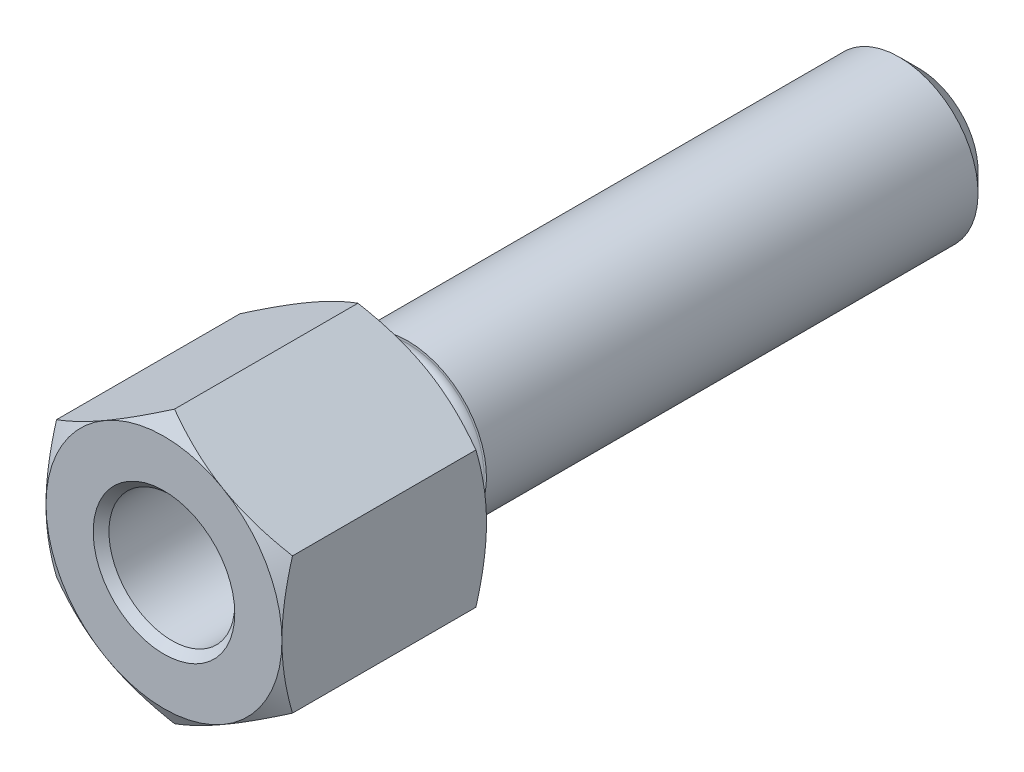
ISO-10303-21;
HEADER;
FILE_DESCRIPTION(('STEP AP214'),'2;1');
FILE_NAME('part.step','',(''),(''),'','','');
FILE_SCHEMA(('AUTOMOTIVE_DESIGN { 1 0 10303 214 1 1 1 1 }'));
ENDSEC;
DATA;
#1=APPLICATION_CONTEXT('core data for automotive mechanical design processes');
#2=APPLICATION_PROTOCOL_DEFINITION('international standard','automotive_design',2000,#1);
#3=PRODUCT_CONTEXT('',#1,'mechanical');
#4=PRODUCT('Part','Part','',(#3));
#5=PRODUCT_RELATED_PRODUCT_CATEGORY('part','',(#4));
#6=PRODUCT_DEFINITION_FORMATION('','',#4);
#7=PRODUCT_DEFINITION_CONTEXT('part definition',#1,'design');
#8=PRODUCT_DEFINITION('design','',#6,#7);
#9=PRODUCT_DEFINITION_SHAPE('','',#8);
#10=(LENGTH_UNIT() NAMED_UNIT(*) SI_UNIT(.MILLI.,.METRE.));
#11=(NAMED_UNIT(*) PLANE_ANGLE_UNIT() SI_UNIT($,.RADIAN.));
#12=(NAMED_UNIT(*) SI_UNIT($,.STERADIAN.) SOLID_ANGLE_UNIT());
#13=UNCERTAINTY_MEASURE_WITH_UNIT(LENGTH_MEASURE(1.E-05),#10,'distance_accuracy_value','');
#14=(GEOMETRIC_REPRESENTATION_CONTEXT(3) GLOBAL_UNCERTAINTY_ASSIGNED_CONTEXT((#13)) GLOBAL_UNIT_ASSIGNED_CONTEXT((#10,
#11,#12)) REPRESENTATION_CONTEXT('',''));
#15=CARTESIAN_POINT('',(0.,0.,0.));
#16=DIRECTION('',(0.,0.,1.));
#17=DIRECTION('',(1.,0.,0.));
#18=AXIS2_PLACEMENT_3D('',#15,#16,#17);
#19=CARTESIAN_POINT('',(0.,17.3205080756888,0.));
#20=DIRECTION('',(0.,0.,1.));
#21=DIRECTION('',(1.,0.,0.));
#22=AXIS2_PLACEMENT_3D('',#19,#20,#21);
#23=PLANE('',#22);
#24=CARTESIAN_POINT('',(0.,0.,0.));
#25=DIRECTION('',(0.,0.,1.));
#26=DIRECTION('',(1.,0.,0.));
#27=AXIS2_PLACEMENT_3D('',#24,#25,#26);
#28=CIRCLE('',#27,9.7);
#29=CARTESIAN_POINT('',(9.7,0.,0.));
#30=VERTEX_POINT('',#29);
#31=EDGE_CURVE('E9',#30,#30,#28,.T.);
#32=ORIENTED_EDGE('',*,*,#31,.T.);
#33=EDGE_LOOP('',(#32));
#34=FACE_BOUND('',#33,.T.);
#35=CARTESIAN_POINT('',(0.,0.,0.));
#36=DIRECTION('',(0.,0.,1.));
#37=DIRECTION('',(1.,0.,0.));
#38=AXIS2_PLACEMENT_3D('',#35,#36,#37);
#39=CIRCLE('',#38,15.);
#40=CARTESIAN_POINT('',(15.,0.,0.));
#41=VERTEX_POINT('',#40);
#42=CARTESIAN_POINT('',(7.5,12.9903810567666,0.));
#43=VERTEX_POINT('',#42);
#44=EDGE_CURVE('E116',#41,#43,#39,.T.);
#45=ORIENTED_EDGE('',*,*,#44,.F.);
#46=CARTESIAN_POINT('',(7.5,-12.9903810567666,0.));
#47=VERTEX_POINT('',#46);
#48=EDGE_CURVE('E110',#47,#41,#39,.T.);
#49=ORIENTED_EDGE('',*,*,#48,.F.);
#50=CARTESIAN_POINT('',(-7.5,-12.9903810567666,0.));
#51=VERTEX_POINT('',#50);
#52=EDGE_CURVE('E310',#51,#47,#39,.T.);
#53=ORIENTED_EDGE('',*,*,#52,.F.);
#54=CARTESIAN_POINT('',(-15.,0.,0.));
#55=VERTEX_POINT('',#54);
#56=EDGE_CURVE('E297',#55,#51,#39,.T.);
#57=ORIENTED_EDGE('',*,*,#56,.F.);
#58=CARTESIAN_POINT('',(-7.5,12.9903810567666,0.));
#59=VERTEX_POINT('',#58);
#60=EDGE_CURVE('E303',#59,#55,#39,.T.);
#61=ORIENTED_EDGE('',*,*,#60,.F.);
#62=EDGE_CURVE('E308',#43,#59,#39,.T.);
#63=ORIENTED_EDGE('',*,*,#62,.F.);
#64=EDGE_LOOP('',(#45,#49,#53,#57,#61,#63));
#65=FACE_BOUND('',#64,.T.);
#66=ADVANCED_FACE('F14',(#34,#65),#23,.F.);
#67=CARTESIAN_POINT('',(0.,0.,-70.));
#68=DIRECTION('',(0.,0.,-1.));
#69=DIRECTION('',(0.,1.,0.));
#70=AXIS2_PLACEMENT_3D('',#67,#68,#69);
#71=CYLINDRICAL_SURFACE('',#70,8.5);
#72=CARTESIAN_POINT('',(0.,0.,-3.8));
#73=DIRECTION('',(0.,0.,-1.));
#74=DIRECTION('',(0.,1.,0.));
#75=AXIS2_PLACEMENT_3D('',#72,#73,#74);
#76=CIRCLE('',#75,8.5);
#77=CARTESIAN_POINT('',(0.,8.5,-3.8));
#78=VERTEX_POINT('',#77);
#79=EDGE_CURVE('E22',#78,#78,#76,.F.);
#80=ORIENTED_EDGE('',*,*,#79,.T.);
#81=EDGE_LOOP('',(#80));
#82=FACE_BOUND('',#81,.T.);
#83=CARTESIAN_POINT('',(0.,0.,-1.2));
#84=DIRECTION('',(0.,0.,1.));
#85=DIRECTION('',(1.,0.,0.));
#86=AXIS2_PLACEMENT_3D('',#83,#84,#85);
#87=CIRCLE('',#86,8.5);
#88=CARTESIAN_POINT('',(8.5,0.,-1.2));
#89=VERTEX_POINT('',#88);
#90=EDGE_CURVE('E154',#89,#89,#87,.F.);
#91=ORIENTED_EDGE('',*,*,#90,.T.);
#92=EDGE_LOOP('',(#91));
#93=FACE_BOUND('',#92,.T.);
#94=ADVANCED_FACE('F159',(#82,#93),#71,.T.);
#95=CARTESIAN_POINT('',(0.,-8.5,-5.));
#96=DIRECTION('',(0.,0.,-1.));
#97=DIRECTION('',(0.,1.,0.));
#98=AXIS2_PLACEMENT_3D('',#95,#96,#97);
#99=PLANE('',#98);
#100=CARTESIAN_POINT('',(0.,0.,-5.));
#101=DIRECTION('',(0.,0.,-1.));
#102=DIRECTION('',(0.,1.,0.));
#103=AXIS2_PLACEMENT_3D('',#100,#101,#102);
#104=CIRCLE('',#103,9.7);
#105=CARTESIAN_POINT('',(0.,9.7,-5.));
#106=VERTEX_POINT('',#105);
#107=EDGE_CURVE('E151',#106,#106,#104,.T.);
#108=ORIENTED_EDGE('',*,*,#107,.T.);
#109=EDGE_LOOP('',(#108));
#110=FACE_BOUND('',#109,.T.);
#111=CARTESIAN_POINT('',(0.,0.,-5.));
#112=DIRECTION('',(0.,0.,-1.));
#113=DIRECTION('',(0.,1.,0.));
#114=AXIS2_PLACEMENT_3D('',#111,#112,#113);
#115=CIRCLE('',#114,10.);
#116=CARTESIAN_POINT('',(0.,10.,-5.));
#117=VERTEX_POINT('',#116);
#118=EDGE_CURVE('E139',#117,#117,#115,.T.);
#119=ORIENTED_EDGE('',*,*,#118,.F.);
#120=EDGE_LOOP('',(#119));
#121=FACE_BOUND('',#120,.T.);
#122=ADVANCED_FACE('F168',(#110,#121),#99,.F.);
#123=CARTESIAN_POINT('',(0.,0.,-70.));
#124=DIRECTION('',(0.,0.,-1.));
#125=DIRECTION('',(0.,1.,0.));
#126=AXIS2_PLACEMENT_3D('',#123,#124,#125);
#127=CYLINDRICAL_SURFACE('',#126,10.);
#128=CARTESIAN_POINT('',(0.,0.,-67.5));
#129=DIRECTION('',(0.,0.,-1.));
#130=DIRECTION('',(0.,1.,0.));
#131=AXIS2_PLACEMENT_3D('',#128,#129,#130);
#132=CIRCLE('',#131,10.);
#133=CARTESIAN_POINT('',(0.,10.,-67.5));
#134=VERTEX_POINT('',#133);
#135=EDGE_CURVE('E176',#134,#134,#132,.T.);
#136=ORIENTED_EDGE('',*,*,#135,.F.);
#137=EDGE_LOOP('',(#136));
#138=FACE_BOUND('',#137,.T.);
#139=ORIENTED_EDGE('',*,*,#118,.T.);
#140=EDGE_LOOP('',(#139));
#141=FACE_BOUND('',#140,.T.);
#142=ADVANCED_FACE('F171',(#138,#141),#127,.T.);
#143=CARTESIAN_POINT('',(0.,0.,-67.5));
#144=DIRECTION('',(0.,0.,1.));
#145=DIRECTION('',(0.,-1.,0.));
#146=AXIS2_PLACEMENT_3D('',#143,#144,#145);
#147=CONICAL_SURFACE('',#146,10.,0.785398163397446);
#148=CARTESIAN_POINT('',(0.,0.,-70.));
#149=DIRECTION('',(0.,0.,-1.));
#150=DIRECTION('',(0.,1.,0.));
#151=AXIS2_PLACEMENT_3D('',#148,#149,#150);
#152=CIRCLE('',#151,7.5);
#153=CARTESIAN_POINT('',(0.,7.5,-70.));
#154=VERTEX_POINT('',#153);
#155=EDGE_CURVE('E178',#154,#154,#152,.T.);
#156=ORIENTED_EDGE('',*,*,#155,.F.);
#157=EDGE_LOOP('',(#156));
#158=FACE_BOUND('',#157,.T.);
#159=ORIENTED_EDGE('',*,*,#135,.T.);
#160=EDGE_LOOP('',(#159));
#161=FACE_BOUND('',#160,.T.);
#162=ADVANCED_FACE('F356',(#158,#161),#147,.T.);
#163=CARTESIAN_POINT('',(0.,-7.5,-70.));
#164=DIRECTION('',(0.,0.,1.));
#165=DIRECTION('',(0.,-1.,0.));
#166=AXIS2_PLACEMENT_3D('',#163,#164,#165);
#167=PLANE('',#166);
#168=ORIENTED_EDGE('',*,*,#155,.T.);
#169=EDGE_LOOP('',(#168));
#170=FACE_BOUND('',#169,.T.);
#171=ADVANCED_FACE('F165',(#170),#167,.F.);
#172=CARTESIAN_POINT('',(0.,0.,-3.8));
#173=DIRECTION('',(0.,0.,-1.));
#174=DIRECTION('',(0.,1.,0.));
#175=AXIS2_PLACEMENT_3D('',#172,#173,#174);
#176=TOROIDAL_SURFACE('',#175,9.7,1.2);
#177=ORIENTED_EDGE('',*,*,#79,.F.);
#178=EDGE_LOOP('',(#177));
#179=FACE_BOUND('',#178,.T.);
#180=ORIENTED_EDGE('',*,*,#107,.F.);
#181=EDGE_LOOP('',(#180));
#182=FACE_BOUND('',#181,.T.);
#183=ADVANCED_FACE('F162',(#179,#182),#176,.F.);
#184=CARTESIAN_POINT('',(0.,0.,-1.2));
#185=DIRECTION('',(0.,0.,1.));
#186=DIRECTION('',(1.,0.,0.));
#187=AXIS2_PLACEMENT_3D('',#184,#185,#186);
#188=TOROIDAL_SURFACE('',#187,9.7,1.2);
#189=ORIENTED_EDGE('',*,*,#31,.F.);
#190=EDGE_LOOP('',(#189));
#191=FACE_BOUND('',#190,.T.);
#192=ORIENTED_EDGE('',*,*,#90,.F.);
#193=EDGE_LOOP('',(#192));
#194=FACE_BOUND('',#193,.T.);
#195=ADVANCED_FACE('F16',(#191,#194),#188,.F.);
#196=CARTESIAN_POINT('',(0.,0.,2.67612328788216));
#197=DIRECTION('',(0.,0.,1.));
#198=DIRECTION('',(1.,0.,0.));
#199=AXIS2_PLACEMENT_3D('',#196,#197,#198);
#200=CONICAL_SURFACE('',#199,19.6351815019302,1.0471975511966);
#201=CARTESIAN_POINT('',(15.0002,-8.66013856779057,1.33981262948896));
#202=CARTESIAN_POINT('',(14.6705058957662,-8.85048754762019,1.22992178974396));
#203=CARTESIAN_POINT('',(14.3395258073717,-9.04157899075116,1.12501758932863));
#204=CARTESIAN_POINT('',(13.674911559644,-9.42529420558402,0.926568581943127));
#205=CARTESIAN_POINT('',(13.3412765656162,-9.61791845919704,0.833027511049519));
#206=CARTESIAN_POINT('',(12.6707077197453,-10.0050715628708,0.65856214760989));
#207=CARTESIAN_POINT('',(12.333767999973,-10.199603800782,0.577667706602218));
#208=CARTESIAN_POINT('',(11.6575472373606,-10.5900200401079,0.430232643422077));
#209=CARTESIAN_POINT('',(11.3182663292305,-10.7859039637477,0.363691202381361));
#210=CARTESIAN_POINT('',(10.6460568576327,-11.1740042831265,0.247792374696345));
#211=CARTESIAN_POINT('',(10.3131781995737,-11.3661918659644,0.198051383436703));
#212=CARTESIAN_POINT('',(9.6458955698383,-11.7514476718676,0.114646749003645));
#213=CARTESIAN_POINT('',(9.3114915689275,-11.9445159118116,0.0809834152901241));
#214=CARTESIAN_POINT('',(8.64212181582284,-12.3309767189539,0.0305840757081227));
#215=CARTESIAN_POINT('',(8.30715720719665,-12.5243686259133,0.0138279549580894));
#216=CARTESIAN_POINT('',(7.63691878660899,-12.9113309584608,-0.00239660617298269));
#217=CARTESIAN_POINT('',(7.30164498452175,-13.1049013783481,-0.00186558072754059));
#218=CARTESIAN_POINT('',(6.6748531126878,-13.4667798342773,0.0152766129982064));
#219=CARTESIAN_POINT('',(6.38329037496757,-13.6351136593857,0.0297968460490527));
#220=CARTESIAN_POINT('',(5.80083556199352,-13.9713941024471,0.071637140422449));
#221=CARTESIAN_POINT('',(5.50994353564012,-14.1393406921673,0.0989581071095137));
#222=CARTESIAN_POINT('',(4.92898814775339,-14.4747554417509,0.165923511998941));
#223=CARTESIAN_POINT('',(4.63892567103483,-14.6422230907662,0.205578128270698));
#224=CARTESIAN_POINT('',(4.06016058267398,-14.9763732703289,0.296515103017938));
#225=CARTESIAN_POINT('',(3.77145806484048,-15.1430557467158,0.347798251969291));
#226=CARTESIAN_POINT('',(2.89508556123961,-15.6490296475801,0.520386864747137));
#227=CARTESIAN_POINT('',(2.30995340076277,-15.9868558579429,0.658901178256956));
#228=CARTESIAN_POINT('',(1.14841408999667,-16.6574708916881,0.973271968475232));
#229=CARTESIAN_POINT('',(0.571992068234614,-16.9902683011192,1.14905461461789));
#230=CARTESIAN_POINT('',(-0.000199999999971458,-17.3206235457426,1.33981262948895));
#231=B_SPLINE_CURVE_WITH_KNOTS('',3,(#201,#202,#203,#204,#205,#206,#207,#208,#209,#210,#211,
#212,#213,#214,#215,#216,#217,#218,#219,#220,#221,#222,#223,#224,#225,#226,#227,#228,#229,#230),
.UNSPECIFIED.,.F.,.F.,(4,2,2,2,2,2,2,2,2,2,2,2,2,2,4),(0.,1.18875411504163,2.37789802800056,
3.56980778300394,4.76164951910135,5.92407379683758,7.08652044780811,8.24758247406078,
9.40860862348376,10.4193068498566,11.4300765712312,12.4416826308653,13.4533574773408,
15.5211962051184,17.584976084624),.UNSPECIFIED.);
#232=CARTESIAN_POINT('',(15.,-8.66025403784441,1.33974596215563));
#233=VERTEX_POINT('',#232);
#234=EDGE_CURVE('E108',#233,#47,#231,.T.);
#235=ORIENTED_EDGE('',*,*,#234,.T.);
#236=ORIENTED_EDGE('',*,*,#48,.T.);
#237=CARTESIAN_POINT('',(15.,-23.1541468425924,7.26786068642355));
#238=CARTESIAN_POINT('',(15.,-22.8270394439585,7.10936231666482));
#239=CARTESIAN_POINT('',(15.,-22.499545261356,6.95166256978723));
#240=CARTESIAN_POINT('',(15.,-21.8437025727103,6.63804141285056));
#241=CARTESIAN_POINT('',(15.,-21.5153540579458,6.48212002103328));
#242=CARTESIAN_POINT('',(15.,-20.5288169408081,6.01725321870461));
#243=CARTESIAN_POINT('',(15.,-19.8692352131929,5.71125301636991));
#244=CARTESIAN_POINT('',(15.,-18.5419796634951,5.1073067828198));
#245=CARTESIAN_POINT('',(15.,-17.8742812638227,4.80941463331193));
#246=CARTESIAN_POINT('',(15.,-16.5335365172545,4.22596167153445));
#247=CARTESIAN_POINT('',(15.,-15.8604904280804,3.940400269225));
#248=CARTESIAN_POINT('',(15.,-14.4866578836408,3.37611782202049));
#249=CARTESIAN_POINT('',(15.,-13.7856654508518,3.09789562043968));
#250=CARTESIAN_POINT('',(15.,-12.3754344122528,2.56277081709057));
#251=CARTESIAN_POINT('',(15.,-11.6661948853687,2.30587062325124));
#252=CARTESIAN_POINT('',(15.,-10.2397277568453,1.82021734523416));
#253=CARTESIAN_POINT('',(15.,-9.52252004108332,1.59140632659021));
#254=CARTESIAN_POINT('',(15.,-8.07774908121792,1.16933284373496));
#255=CARTESIAN_POINT('',(15.,-7.35018921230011,0.976059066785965));
#256=CARTESIAN_POINT('',(15.,-6.25297835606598,0.72037608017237));
#257=CARTESIAN_POINT('',(15.,-5.88725165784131,0.641020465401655));
#258=CARTESIAN_POINT('',(15.,-5.15331985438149,0.494673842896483));
#259=CARTESIAN_POINT('',(15.,-4.78511480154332,0.427682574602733));
#260=CARTESIAN_POINT('',(15.,-4.04648662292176,0.307253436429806));
#261=CARTESIAN_POINT('',(15.,-3.67606351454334,0.253815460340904));
#262=CARTESIAN_POINT('',(15.,-2.93340375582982,0.161563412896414));
#263=CARTESIAN_POINT('',(15.,-2.5611671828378,0.122748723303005));
#264=CARTESIAN_POINT('',(15.,-1.82020992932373,0.0609945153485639));
#265=CARTESIAN_POINT('',(15.,-1.45150589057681,0.0378565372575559));
#266=CARTESIAN_POINT('',(15.,-0.713450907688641,0.00718593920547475));
#267=CARTESIAN_POINT('',(15.,-0.344099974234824,-0.000346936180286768));
#268=CARTESIAN_POINT('',(15.,0.394591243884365,0.000371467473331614));
#269=CARTESIAN_POINT('',(15.,0.763931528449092,0.00862286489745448));
#270=CARTESIAN_POINT('',(15.,1.50193814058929,0.0407104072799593));
#271=CARTESIAN_POINT('',(15.,1.87060443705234,0.0645472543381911));
#272=CARTESIAN_POINT('',(15.,2.75995231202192,0.140347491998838));
#273=CARTESIAN_POINT('',(15.,3.27999899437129,0.199890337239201));
#274=CARTESIAN_POINT('',(15.,4.31616384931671,0.34671933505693));
#275=CARTESIAN_POINT('',(15.,4.8322814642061,0.434009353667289));
#276=CARTESIAN_POINT('',(15.,5.86012050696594,0.633227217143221));
#277=CARTESIAN_POINT('',(15.,6.37183810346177,0.745174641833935));
#278=CARTESIAN_POINT('',(15.,7.39010647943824,0.990297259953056));
#279=CARTESIAN_POINT('',(15.,7.89665734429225,1.12347210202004));
#280=CARTESIAN_POINT('',(15.,8.91562704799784,1.41093367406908));
#281=CARTESIAN_POINT('',(15.,9.42793314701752,1.56561728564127));
#282=CARTESIAN_POINT('',(15.,10.4474976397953,1.89072673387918));
#283=CARTESIAN_POINT('',(15.,10.954756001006,2.06115267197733));
#284=CARTESIAN_POINT('',(15.,11.9644795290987,2.41506191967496));
#285=CARTESIAN_POINT('',(15.,12.4669462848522,2.5985407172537));
#286=CARTESIAN_POINT('',(15.,13.4677327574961,2.97642075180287));
#287=CARTESIAN_POINT('',(15.,13.9660525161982,3.17082187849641));
#288=CARTESIAN_POINT('',(15.,15.1134546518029,3.63061893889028));
#289=CARTESIAN_POINT('',(15.,15.7612222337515,3.89929033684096));
#290=CARTESIAN_POINT('',(15.,17.0514717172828,4.44907303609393));
#291=CARTESIAN_POINT('',(15.,17.6939533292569,4.73018501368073));
#292=CARTESIAN_POINT('',(15.,18.9745772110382,5.30243672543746));
#293=CARTESIAN_POINT('',(15.,19.6127185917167,5.59357844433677));
#294=CARTESIAN_POINT('',(15.,20.8852339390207,6.18393265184));
#295=CARTESIAN_POINT('',(15.,21.5196079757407,6.48314498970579));
#296=CARTESIAN_POINT('',(15.,22.78582958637,7.08848076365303));
#297=CARTESIAN_POINT('',(15.,23.4176739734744,7.39461085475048));
#298=CARTESIAN_POINT('',(15.,24.678683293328,8.01233937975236));
#299=CARTESIAN_POINT('',(15.,25.3078482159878,8.32393783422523));
#300=CARTESIAN_POINT('',(15.,26.5638262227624,8.95165507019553));
#301=CARTESIAN_POINT('',(15.,27.1906395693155,9.2677733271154));
#302=CARTESIAN_POINT('',(15.,28.4423181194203,9.90384551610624));
#303=CARTESIAN_POINT('',(15.,29.0671833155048,10.2237994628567));
#304=CARTESIAN_POINT('',(15.,30.8392576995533,11.1369758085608));
#305=CARTESIAN_POINT('',(15.,31.984477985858,11.7340578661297));
#306=CARTESIAN_POINT('',(15.,34.270622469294,12.9364582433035));
#307=CARTESIAN_POINT('',(15.,35.4115465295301,13.5417768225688));
#308=CARTESIAN_POINT('',(15.,37.6873636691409,14.7573405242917));
#309=CARTESIAN_POINT('',(15.,38.822264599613,15.3675709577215));
#310=CARTESIAN_POINT('',(15.,40.5225744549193,16.2866199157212));
#311=CARTESIAN_POINT('',(15.,41.0889899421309,16.5935790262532));
#312=CARTESIAN_POINT('',(15.,42.2212155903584,17.2086095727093));
#313=CARTESIAN_POINT('',(15.,42.7870257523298,17.5166810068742));
#314=CARTESIAN_POINT('',(15.,43.352566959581,17.8252455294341));
#315=B_SPLINE_CURVE_WITH_KNOTS('',3,(#237,#238,#239,#240,#241,#242,#243,#244,#245,#246,#247,
#248,#249,#250,#251,#252,#253,#254,#255,#256,#257,#258,#259,#260,#261,#262,#263,#264,#265,#266,
#267,#268,#269,#270,#271,#272,#273,#274,#275,#276,#277,#278,#279,#280,#281,#282,#283,#284,#285,
#286,#287,#288,#289,#290,#291,#292,#293,#294,#295,#296,#297,#298,#299,#300,#301,#302,#303,#304,
#305,#306,#307,#308,#309,#310,#311,#312,#313,#314),.UNSPECIFIED.,.F.,.F.,(4,2,2,2,2,2,2,2,2,2,2,
2,2,2,2,2,2,2,2,2,2,2,2,2,2,2,2,2,2,2,2,2,2,2,2,2,2,2,4),(0.,1.09045149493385,2.18091416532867,
4.36216784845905,6.5554808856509,8.74868885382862,11.0109849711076,13.2735362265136,
15.531339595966,17.7884229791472,18.9109587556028,20.0334708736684,21.1559741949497,
22.2784300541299,23.3863964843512,24.4943447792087,25.6023013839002,26.7103079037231,
28.2797697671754,29.8494504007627,31.4203820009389,32.9912876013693,34.5964320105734,
36.2015867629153,37.8061893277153,39.4107756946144,41.514428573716,43.6181959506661,
45.7223820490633,47.8265288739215,49.9327942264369,52.0390675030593,54.1450982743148,
56.2511371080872,60.1256612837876,64.0003078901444,67.8659646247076,69.7986958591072,
71.7314240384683),.UNSPECIFIED.);
#316=EDGE_CURVE('E105',#41,#233,#315,.F.);
#317=ORIENTED_EDGE('',*,*,#316,.T.);
#318=EDGE_LOOP('',(#235,#236,#317));
#319=FACE_BOUND('',#318,.T.);
#320=ADVANCED_FACE('F107',(#319),#200,.T.);
#321=CARTESIAN_POINT('',(0.000200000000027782,-17.3206235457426,1.33981262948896));
#322=CARTESIAN_POINT('',(-0.32949410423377,-17.130274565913,1.22992178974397));
#323=CARTESIAN_POINT('',(-0.660474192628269,-16.9391831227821,1.12501758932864));
#324=CARTESIAN_POINT('',(-1.32508844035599,-16.5554679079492,0.926568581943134));
#325=CARTESIAN_POINT('',(-1.65872343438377,-16.3628436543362,0.833027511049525));
#326=CARTESIAN_POINT('',(-2.3292922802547,-15.9756905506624,0.658562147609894));
#327=CARTESIAN_POINT('',(-2.66623200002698,-15.7811583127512,0.577667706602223));
#328=CARTESIAN_POINT('',(-3.34245276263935,-15.3907420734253,0.430232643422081));
#329=CARTESIAN_POINT('',(-3.68173367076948,-15.1948581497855,0.363691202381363));
#330=CARTESIAN_POINT('',(-4.35394314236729,-14.8067578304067,0.247792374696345));
#331=CARTESIAN_POINT('',(-4.68682180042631,-14.6145702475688,0.198051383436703));
#332=CARTESIAN_POINT('',(-5.35410443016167,-14.2293144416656,0.114646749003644));
#333=CARTESIAN_POINT('',(-5.68850843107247,-14.0362462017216,0.0809834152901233));
#334=CARTESIAN_POINT('',(-6.35787818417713,-13.6497853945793,0.0305840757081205));
#335=CARTESIAN_POINT('',(-6.69284279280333,-13.4563934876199,0.0138279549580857));
#336=CARTESIAN_POINT('',(-7.36308121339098,-13.0694311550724,-0.00239660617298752));
#337=CARTESIAN_POINT('',(-7.69835501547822,-12.8758607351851,-0.00186558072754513));
#338=CARTESIAN_POINT('',(-8.32514688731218,-12.5139822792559,0.0152766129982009));
#339=CARTESIAN_POINT('',(-8.6167096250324,-12.3456484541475,0.0297968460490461));
#340=CARTESIAN_POINT('',(-9.19916443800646,-12.0093680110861,0.0716371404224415));
#341=CARTESIAN_POINT('',(-9.49005646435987,-11.8414214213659,0.0989581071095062));
#342=CARTESIAN_POINT('',(-10.0710118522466,-11.5060066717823,0.165923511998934));
#343=CARTESIAN_POINT('',(-10.3610743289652,-11.338539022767,0.205578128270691));
#344=CARTESIAN_POINT('',(-10.939839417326,-11.0043888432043,0.296515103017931));
#345=CARTESIAN_POINT('',(-11.2285419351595,-10.8377063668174,0.347798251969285));
#346=CARTESIAN_POINT('',(-12.1049144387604,-10.3317324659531,0.520386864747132));
#347=CARTESIAN_POINT('',(-12.6900465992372,-9.99390625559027,0.658901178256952));
#348=CARTESIAN_POINT('',(-13.8515859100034,-9.32329122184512,0.973271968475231));
#349=CARTESIAN_POINT('',(-14.4280079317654,-8.99049381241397,1.14905461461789));
#350=CARTESIAN_POINT('',(-15.0002,-8.66013856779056,1.33981262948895));
#351=B_SPLINE_CURVE_WITH_KNOTS('',3,(#321,#322,#323,#324,#325,#326,#327,#328,#329,#330,#331,
#332,#333,#334,#335,#336,#337,#338,#339,#340,#341,#342,#343,#344,#345,#346,#347,#348,#349,#350),
.UNSPECIFIED.,.F.,.F.,(4,2,2,2,2,2,2,2,2,2,2,2,2,2,4),(0.,1.18875411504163,2.37789802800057,
3.56980778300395,4.76164951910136,5.92407379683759,7.08652044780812,8.24758247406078,
9.40860862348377,10.4193068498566,11.4300765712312,12.4416826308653,13.4533574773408,
15.5211962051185,17.5849760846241),.UNSPECIFIED.);
#352=CARTESIAN_POINT('',(0.,-17.3205080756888,1.33974596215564));
#353=VERTEX_POINT('',#352);
#354=EDGE_CURVE('E317',#353,#51,#351,.T.);
#355=ORIENTED_EDGE('',*,*,#354,.T.);
#356=ORIENTED_EDGE('',*,*,#52,.T.);
#357=EDGE_CURVE('E125',#47,#353,#231,.T.);
#358=ORIENTED_EDGE('',*,*,#357,.T.);
#359=EDGE_LOOP('',(#355,#356,#358));
#360=FACE_BOUND('',#359,.T.);
#361=ADVANCED_FACE('F382',(#360),#200,.T.);
#362=CARTESIAN_POINT('',(-15.,-23.1541468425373,7.26786068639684));
#363=CARTESIAN_POINT('',(-15.,-22.8270394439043,7.10936231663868));
#364=CARTESIAN_POINT('',(-15.,-22.4995452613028,6.95166256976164));
#365=CARTESIAN_POINT('',(-15.,-21.8437025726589,6.63804141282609));
#366=CARTESIAN_POINT('',(-15.,-21.5153540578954,6.48212002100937));
#367=CARTESIAN_POINT('',(-15.,-20.5288169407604,6.01725321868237));
#368=CARTESIAN_POINT('',(-15.,-19.8692352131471,5.71125301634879));
#369=CARTESIAN_POINT('',(-15.,-18.541979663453,5.1073067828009));
#370=CARTESIAN_POINT('',(-15.,-17.8742812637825,4.80941463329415));
#371=CARTESIAN_POINT('',(-15.,-16.5335365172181,4.22596167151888));
#372=CARTESIAN_POINT('',(-15.,-15.8604904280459,3.94040026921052));
#373=CARTESIAN_POINT('',(-15.,-14.4866578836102,3.37611782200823));
#374=CARTESIAN_POINT('',(-15.,-13.7856654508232,3.09789562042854));
#375=CARTESIAN_POINT('',(-15.,-12.3754344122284,2.56277081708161));
#376=CARTESIAN_POINT('',(-15.,-11.6661948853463,2.30587062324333));
#377=CARTESIAN_POINT('',(-15.,-10.2397277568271,1.82021734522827));
#378=CARTESIAN_POINT('',(-15.,-9.52252004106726,1.59140632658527));
#379=CARTESIAN_POINT('',(-15.,-8.07774908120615,1.16933284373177));
#380=CARTESIAN_POINT('',(-15.,-7.35018921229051,0.976059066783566));
#381=CARTESIAN_POINT('',(-15.,-6.25297835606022,0.720376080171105));
#382=CARTESIAN_POINT('',(-15.,-5.8872516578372,0.641020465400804));
#383=CARTESIAN_POINT('',(-15.,-5.15331985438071,0.494673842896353));
#384=CARTESIAN_POINT('',(-15.,-4.78511480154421,0.42768257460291));
#385=CARTESIAN_POINT('',(-15.,-4.04648662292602,0.307253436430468));
#386=CARTESIAN_POINT('',(-15.,-3.6760635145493,0.253815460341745));
#387=CARTESIAN_POINT('',(-15.,-2.93340375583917,0.161563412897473));
#388=CARTESIAN_POINT('',(-15.,-2.56116718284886,0.122748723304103));
#389=CARTESIAN_POINT('',(-15.,-1.82020992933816,0.0609945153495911));
#390=CARTESIAN_POINT('',(-15.,-1.45150589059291,0.0378565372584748));
#391=CARTESIAN_POINT('',(-15.,-0.71345090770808,0.00718593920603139));
#392=CARTESIAN_POINT('',(-15.,-0.344099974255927,-0.000346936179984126));
#393=CARTESIAN_POINT('',(-15.,0.394591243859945,0.000371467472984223));
#394=CARTESIAN_POINT('',(-15.,0.76393152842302,0.00862286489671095));
#395=CARTESIAN_POINT('',(-15.,1.50193814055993,0.0407104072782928));
#396=CARTESIAN_POINT('',(-15.,1.87060443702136,0.0645472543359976));
#397=CARTESIAN_POINT('',(-15.,2.75995231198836,0.140347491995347));
#398=CARTESIAN_POINT('',(-15.,3.2799989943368,0.199890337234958));
#399=CARTESIAN_POINT('',(-15.,4.3161638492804,0.346719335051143));
#400=CARTESIAN_POINT('',(-15.,4.83228146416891,0.434009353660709));
#401=CARTESIAN_POINT('',(-15.,5.860120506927,0.633227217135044));
#402=CARTESIAN_POINT('',(-15.,6.37183810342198,0.745174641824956));
#403=CARTESIAN_POINT('',(-15.,7.39010647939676,0.990297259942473));
#404=CARTESIAN_POINT('',(-15.,7.89665734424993,1.12347210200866));
#405=CARTESIAN_POINT('',(-15.,8.91562704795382,1.4109336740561));
#406=CARTESIAN_POINT('',(-15.,9.42793314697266,1.56561728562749));
#407=CARTESIAN_POINT('',(-15.,10.4474976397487,1.89072673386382));
#408=CARTESIAN_POINT('',(-15.,10.9547560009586,2.06115267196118));
#409=CARTESIAN_POINT('',(-15.,11.9644795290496,2.41506191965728));
#410=CARTESIAN_POINT('',(-15.,12.4669462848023,2.59854071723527));
#411=CARTESIAN_POINT('',(-15.,13.4677327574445,2.97642075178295));
#412=CARTESIAN_POINT('',(-15.,13.9660525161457,3.17082187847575));
#413=CARTESIAN_POINT('',(-15.,15.1134546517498,3.63061893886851));
#414=CARTESIAN_POINT('',(-15.,15.7612222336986,3.89929033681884));
#415=CARTESIAN_POINT('',(-15.,17.0514717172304,4.44907303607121));
#416=CARTESIAN_POINT('',(-15.,17.6939533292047,4.73018501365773));
#417=CARTESIAN_POINT('',(-15.,18.9745772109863,5.30243672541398));
#418=CARTESIAN_POINT('',(-15.,19.612718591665,5.59357844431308));
#419=CARTESIAN_POINT('',(-15.,20.8852339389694,6.18393265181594));
#420=CARTESIAN_POINT('',(-15.,21.5196079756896,6.48314498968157));
#421=CARTESIAN_POINT('',(-15.,22.7858295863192,7.08848076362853));
#422=CARTESIAN_POINT('',(-15.,23.4176739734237,7.39461085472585));
#423=CARTESIAN_POINT('',(-15.,24.6786832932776,8.01233937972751));
#424=CARTESIAN_POINT('',(-15.,25.3078482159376,8.32393783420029));
#425=CARTESIAN_POINT('',(-15.,26.5638262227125,8.95165507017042));
#426=CARTESIAN_POINT('',(-15.,27.1906395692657,9.26777332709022));
#427=CARTESIAN_POINT('',(-15.,28.4423181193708,9.90384551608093));
#428=CARTESIAN_POINT('',(-15.,29.0671833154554,10.2237994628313));
#429=CARTESIAN_POINT('',(-15.,30.839257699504,11.1369758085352));
#430=CARTESIAN_POINT('',(-15.,31.9844779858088,11.734057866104));
#431=CARTESIAN_POINT('',(-15.,34.2706224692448,12.9364582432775));
#432=CARTESIAN_POINT('',(-15.,35.4115465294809,13.5417768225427));
#433=CARTESIAN_POINT('',(-15.,37.6873636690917,14.7573405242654));
#434=CARTESIAN_POINT('',(-15.,38.8222645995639,15.367570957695));
#435=CARTESIAN_POINT('',(-15.,40.5225744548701,16.2866199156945));
#436=CARTESIAN_POINT('',(-15.,41.0889899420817,16.5935790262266));
#437=CARTESIAN_POINT('',(-15.,42.2212155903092,17.2086095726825));
#438=CARTESIAN_POINT('',(-15.,42.7870257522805,17.5166810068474));
#439=CARTESIAN_POINT('',(-15.,43.3525669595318,17.8252455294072));
#440=B_SPLINE_CURVE_WITH_KNOTS('',3,(#362,#363,#364,#365,#366,#367,#368,#369,#370,#371,#372,
#373,#374,#375,#376,#377,#378,#379,#380,#381,#382,#383,#384,#385,#386,#387,#388,#389,#390,#391,
#392,#393,#394,#395,#396,#397,#398,#399,#400,#401,#402,#403,#404,#405,#406,#407,#408,#409,#410,
#411,#412,#413,#414,#415,#416,#417,#418,#419,#420,#421,#422,#423,#424,#425,#426,#427,#428,#429,
#430,#431,#432,#433,#434,#435,#436,#437,#438,#439),.UNSPECIFIED.,.F.,.F.,(4,2,2,2,2,2,2,2,2,2,2,
2,2,2,2,2,2,2,2,2,2,2,2,2,2,2,2,2,2,2,2,2,2,2,2,2,2,2,4),(0.,1.09045149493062,2.18091416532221,
4.36216784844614,6.55548088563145,8.74868885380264,11.0109849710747,13.2735362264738,
15.5313395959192,17.7884229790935,18.9109587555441,20.0334708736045,21.1559741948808,
22.2784300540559,23.3863964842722,24.4943447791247,25.6023013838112,26.7103079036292,
28.2797697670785,29.8494504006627,31.4203820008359,32.9912876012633,34.5964320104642,
36.2015867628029,37.8061893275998,39.4107756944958,41.5144285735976,43.6181959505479,
45.7223820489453,47.8265288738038,49.9327942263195,52.039067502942,54.1450982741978,
56.2511371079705,60.1256612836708,64.0003078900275,67.8659646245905,69.79869585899,
71.731424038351),.UNSPECIFIED.);
#441=CARTESIAN_POINT('',(-15.,-8.6602540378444,1.33974596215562));
#442=VERTEX_POINT('',#441);
#443=EDGE_CURVE('E272',#442,#55,#440,.T.);
#444=ORIENTED_EDGE('',*,*,#443,.T.);
#445=ORIENTED_EDGE('',*,*,#56,.T.);
#446=EDGE_CURVE('E273',#51,#442,#351,.T.);
#447=ORIENTED_EDGE('',*,*,#446,.T.);
#448=EDGE_LOOP('',(#444,#445,#447));
#449=FACE_BOUND('',#448,.T.);
#450=ADVANCED_FACE('F216',(#449),#200,.T.);
#451=CARTESIAN_POINT('',(-15.,8.66025403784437,1.33974596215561));
#452=VERTEX_POINT('',#451);
#453=EDGE_CURVE('E266',#55,#452,#440,.T.);
#454=ORIENTED_EDGE('',*,*,#453,.T.);
#455=CARTESIAN_POINT('',(-15.0002,8.66013856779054,1.33981262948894));
#456=CARTESIAN_POINT('',(-14.6705058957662,8.85048754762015,1.22992178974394));
#457=CARTESIAN_POINT('',(-14.3395258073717,9.04157899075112,1.12501758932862));
#458=CARTESIAN_POINT('',(-13.674911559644,9.42529420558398,0.926568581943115));
#459=CARTESIAN_POINT('',(-13.3412765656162,9.617918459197,0.833027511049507));
#460=CARTESIAN_POINT('',(-12.6707077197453,10.0050715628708,0.658562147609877));
#461=CARTESIAN_POINT('',(-12.333767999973,10.199603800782,0.577667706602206));
#462=CARTESIAN_POINT('',(-11.6575472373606,10.5900200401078,0.430232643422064));
#463=CARTESIAN_POINT('',(-11.3182663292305,10.7859039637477,0.363691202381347));
#464=CARTESIAN_POINT('',(-10.6460568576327,11.1740042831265,0.24779237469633));
#465=CARTESIAN_POINT('',(-10.3131781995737,11.3661918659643,0.198051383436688));
#466=CARTESIAN_POINT('',(-9.64589556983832,11.7514476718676,0.114646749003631));
#467=CARTESIAN_POINT('',(-9.31149156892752,11.9445159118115,0.0809834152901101));
#468=CARTESIAN_POINT('',(-8.64212181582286,12.3309767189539,0.0305840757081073));
#469=CARTESIAN_POINT('',(-8.30715720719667,12.5243686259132,0.0138279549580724));
#470=CARTESIAN_POINT('',(-7.63691878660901,12.9113309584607,-0.00239660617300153));
#471=CARTESIAN_POINT('',(-7.30164498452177,13.104901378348,-0.00186558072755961));
#472=CARTESIAN_POINT('',(-6.67485311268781,13.4667798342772,0.0152766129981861));
#473=CARTESIAN_POINT('',(-6.38329037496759,13.6351136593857,0.0297968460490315));
#474=CARTESIAN_POINT('',(-5.80083556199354,13.971394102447,0.0716371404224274));
#475=CARTESIAN_POINT('',(-5.50994353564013,14.1393406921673,0.0989581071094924));
#476=CARTESIAN_POINT('',(-4.92898814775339,14.4747554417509,0.16592351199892));
#477=CARTESIAN_POINT('',(-4.63892567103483,14.6422230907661,0.205578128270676));
#478=CARTESIAN_POINT('',(-4.06016058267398,14.9763732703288,0.296515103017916));
#479=CARTESIAN_POINT('',(-3.77145806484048,15.1430557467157,0.347798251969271));
#480=CARTESIAN_POINT('',(-2.8950855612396,15.6490296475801,0.520386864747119));
#481=CARTESIAN_POINT('',(-2.30995340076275,15.9868558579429,0.65890117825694));
#482=CARTESIAN_POINT('',(-1.14841408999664,16.657470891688,0.973271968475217));
#483=CARTESIAN_POINT('',(-0.57199206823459,16.9902683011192,1.14905461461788));
#484=CARTESIAN_POINT('',(0.000199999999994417,17.3206235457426,1.33981262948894));
#485=B_SPLINE_CURVE_WITH_KNOTS('',3,(#455,#456,#457,#458,#459,#460,#461,#462,#463,#464,#465,
#466,#467,#468,#469,#470,#471,#472,#473,#474,#475,#476,#477,#478,#479,#480,#481,#482,#483,#484),
.UNSPECIFIED.,.F.,.F.,(4,2,2,2,2,2,2,2,2,2,2,2,2,2,4),(0.,1.18875411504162,2.37789802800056,
3.56980778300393,4.76164951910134,5.92407379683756,7.08652044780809,8.24758247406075,
9.40860862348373,10.4193068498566,11.4300765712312,12.4416826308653,13.4533574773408,
15.5211962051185,17.5849760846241),.UNSPECIFIED.);
#486=EDGE_CURVE('E37',#452,#59,#485,.T.);
#487=ORIENTED_EDGE('',*,*,#486,.T.);
#488=ORIENTED_EDGE('',*,*,#60,.T.);
#489=EDGE_LOOP('',(#454,#487,#488));
#490=FACE_BOUND('',#489,.T.);
#491=ADVANCED_FACE('F304',(#490),#200,.T.);
#492=CARTESIAN_POINT('',(0.,17.3205080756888,1.33974596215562));
#493=VERTEX_POINT('',#492);
#494=EDGE_CURVE('E274',#59,#493,#485,.T.);
#495=ORIENTED_EDGE('',*,*,#494,.T.);
#496=CARTESIAN_POINT('',(-0.000200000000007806,17.3206235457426,1.33981262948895));
#497=CARTESIAN_POINT('',(0.329494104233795,17.130274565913,1.22992178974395));
#498=CARTESIAN_POINT('',(0.660474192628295,16.939183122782,1.12501758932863));
#499=CARTESIAN_POINT('',(1.32508844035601,16.5554679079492,0.926568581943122));
#500=CARTESIAN_POINT('',(1.6587234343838,16.3628436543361,0.833027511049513));
#501=CARTESIAN_POINT('',(2.32929228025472,15.9756905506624,0.658562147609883));
#502=CARTESIAN_POINT('',(2.666232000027,15.7811583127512,0.577667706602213));
#503=CARTESIAN_POINT('',(3.34245276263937,15.3907420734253,0.430232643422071));
#504=CARTESIAN_POINT('',(3.6817336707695,15.1948581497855,0.363691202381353));
#505=CARTESIAN_POINT('',(4.3539431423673,14.8067578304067,0.247792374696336));
#506=CARTESIAN_POINT('',(4.68682180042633,14.6145702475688,0.198051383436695));
#507=CARTESIAN_POINT('',(5.35410443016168,14.2293144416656,0.114646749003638));
#508=CARTESIAN_POINT('',(5.68850843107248,14.0362462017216,0.0809834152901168));
#509=CARTESIAN_POINT('',(6.35787818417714,13.6497853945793,0.0305840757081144));
#510=CARTESIAN_POINT('',(6.69284279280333,13.4563934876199,0.0138279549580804));
#511=CARTESIAN_POINT('',(7.36308121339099,13.0694311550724,-0.00239660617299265));
#512=CARTESIAN_POINT('',(7.69835501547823,12.8758607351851,-0.00186558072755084));
#513=CARTESIAN_POINT('',(8.32514688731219,12.5139822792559,0.0152766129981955));
#514=CARTESIAN_POINT('',(8.61670962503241,12.3456484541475,0.0297968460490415));
#515=CARTESIAN_POINT('',(9.19916443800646,12.0093680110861,0.0716371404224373));
#516=CARTESIAN_POINT('',(9.49005646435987,11.8414214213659,0.0989581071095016));
#517=CARTESIAN_POINT('',(10.0710118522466,11.5060066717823,0.165923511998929));
#518=CARTESIAN_POINT('',(10.3610743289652,11.338539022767,0.205578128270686));
#519=CARTESIAN_POINT('',(10.939839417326,11.0043888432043,0.296515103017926));
#520=CARTESIAN_POINT('',(11.2285419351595,10.8377063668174,0.34779825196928));
#521=CARTESIAN_POINT('',(12.1049144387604,10.3317324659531,0.520386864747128));
#522=CARTESIAN_POINT('',(12.6900465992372,9.99390625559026,0.658901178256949));
#523=CARTESIAN_POINT('',(13.8515859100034,9.32329122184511,0.973271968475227));
#524=CARTESIAN_POINT('',(14.4280079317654,8.99049381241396,1.14905461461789));
#525=CARTESIAN_POINT('',(15.0002,8.66013856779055,1.33981262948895));
#526=B_SPLINE_CURVE_WITH_KNOTS('',3,(#496,#497,#498,#499,#500,#501,#502,#503,#504,#505,#506,
#507,#508,#509,#510,#511,#512,#513,#514,#515,#516,#517,#518,#519,#520,#521,#522,#523,#524,#525),
.UNSPECIFIED.,.F.,.F.,(4,2,2,2,2,2,2,2,2,2,2,2,2,2,4),(0.,1.18875411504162,2.37789802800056,
3.56980778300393,4.76164951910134,5.92407379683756,7.08652044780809,8.24758247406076,
9.40860862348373,10.4193068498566,11.4300765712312,12.4416826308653,13.4533574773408,
15.5211962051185,17.5849760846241),.UNSPECIFIED.);
#527=EDGE_CURVE('E29',#493,#43,#526,.T.);
#528=ORIENTED_EDGE('',*,*,#527,.T.);
#529=ORIENTED_EDGE('',*,*,#62,.T.);
#530=EDGE_LOOP('',(#495,#528,#529));
#531=FACE_BOUND('',#530,.T.);
#532=ADVANCED_FACE('F380',(#531),#200,.T.);
#533=CARTESIAN_POINT('',(15.,8.66025403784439,1.33974596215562));
#534=VERTEX_POINT('',#533);
#535=EDGE_CURVE('E126',#43,#534,#526,.T.);
#536=ORIENTED_EDGE('',*,*,#535,.T.);
#537=EDGE_CURVE('E115',#534,#41,#315,.F.);
#538=ORIENTED_EDGE('',*,*,#537,.T.);
#539=ORIENTED_EDGE('',*,*,#44,.T.);
#540=EDGE_LOOP('',(#536,#538,#539));
#541=FACE_BOUND('',#540,.T.);
#542=ADVANCED_FACE('F370',(#541),#200,.T.);
#543=CARTESIAN_POINT('',(0.,0.,4.));
#544=DIRECTION('',(0.,0.,1.));
#545=DIRECTION('',(1.,0.,0.));
#546=AXIS2_PLACEMENT_3D('',#543,#544,#545);
#547=CYLINDRICAL_SURFACE('',#546,8.);
#548=CARTESIAN_POINT('',(0.,0.,10.));
#549=DIRECTION('',(0.,0.,1.));
#550=DIRECTION('',(1.,0.,0.));
#551=AXIS2_PLACEMENT_3D('',#548,#549,#550);
#552=CIRCLE('',#551,8.);
#553=CARTESIAN_POINT('',(8.,0.,10.));
#554=VERTEX_POINT('',#553);
#555=EDGE_CURVE('E385',#554,#554,#552,.T.);
#556=ORIENTED_EDGE('',*,*,#555,.F.);
#557=EDGE_LOOP('',(#556));
#558=FACE_BOUND('',#557,.T.);
#559=CARTESIAN_POINT('',(0.,0.,25.));
#560=DIRECTION('',(0.,0.,1.));
#561=DIRECTION('',(1.,0.,0.));
#562=AXIS2_PLACEMENT_3D('',#559,#560,#561);
#563=CIRCLE('',#562,8.);
#564=CARTESIAN_POINT('',(8.,0.,25.));
#565=VERTEX_POINT('',#564);
#566=EDGE_CURVE('E186',#565,#565,#563,.F.);
#567=ORIENTED_EDGE('',*,*,#566,.F.);
#568=EDGE_LOOP('',(#567));
#569=FACE_BOUND('',#568,.T.);
#570=ADVANCED_FACE('F219',(#558,#569),#547,.F.);
#571=CARTESIAN_POINT('',(0.,0.,26.));
#572=DIRECTION('',(0.,0.,1.));
#573=DIRECTION('',(1.,0.,0.));
#574=AXIS2_PLACEMENT_3D('',#571,#572,#573);
#575=CONICAL_SURFACE('',#574,9.,0.785398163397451);
#576=ORIENTED_EDGE('',*,*,#566,.T.);
#577=EDGE_LOOP('',(#576));
#578=FACE_BOUND('',#577,.T.);
#579=CARTESIAN_POINT('',(0.,0.,26.));
#580=DIRECTION('',(0.,0.,1.));
#581=DIRECTION('',(1.,0.,0.));
#582=AXIS2_PLACEMENT_3D('',#579,#580,#581);
#583=CIRCLE('',#582,9.);
#584=CARTESIAN_POINT('',(9.,0.,26.));
#585=VERTEX_POINT('',#584);
#586=EDGE_CURVE('E183',#585,#585,#583,.T.);
#587=ORIENTED_EDGE('',*,*,#586,.T.);
#588=EDGE_LOOP('',(#587));
#589=FACE_BOUND('',#588,.T.);
#590=ADVANCED_FACE('F350',(#578,#589),#575,.F.);
#591=CARTESIAN_POINT('',(0.,17.3205080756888,26.));
#592=DIRECTION('',(0.,0.,1.));
#593=DIRECTION('',(1.,0.,0.));
#594=AXIS2_PLACEMENT_3D('',#591,#592,#593);
#595=PLANE('',#594);
#596=ORIENTED_EDGE('',*,*,#586,.F.);
#597=EDGE_LOOP('',(#596));
#598=FACE_BOUND('',#597,.T.);
#599=CARTESIAN_POINT('',(0.,0.,26.));
#600=DIRECTION('',(0.,0.,1.));
#601=DIRECTION('',(1.,0.,0.));
#602=AXIS2_PLACEMENT_3D('',#599,#600,#601);
#603=CIRCLE('',#602,15.);
#604=CARTESIAN_POINT('',(7.5,-12.9903810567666,26.));
#605=VERTEX_POINT('',#604);
#606=CARTESIAN_POINT('',(15.,0.,26.));
#607=VERTEX_POINT('',#606);
#608=EDGE_CURVE('E283',#605,#607,#603,.T.);
#609=ORIENTED_EDGE('',*,*,#608,.T.);
#610=CARTESIAN_POINT('',(7.5,12.9903810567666,26.));
#611=VERTEX_POINT('',#610);
#612=EDGE_CURVE('E280',#607,#611,#603,.T.);
#613=ORIENTED_EDGE('',*,*,#612,.T.);
#614=CARTESIAN_POINT('',(-7.5,12.9903810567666,26.));
#615=VERTEX_POINT('',#614);
#616=EDGE_CURVE('E282',#611,#615,#603,.T.);
#617=ORIENTED_EDGE('',*,*,#616,.T.);
#618=CARTESIAN_POINT('',(-15.,0.,26.));
#619=VERTEX_POINT('',#618);
#620=EDGE_CURVE('E288',#615,#619,#603,.T.);
#621=ORIENTED_EDGE('',*,*,#620,.T.);
#622=CARTESIAN_POINT('',(-7.5,-12.9903810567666,26.));
#623=VERTEX_POINT('',#622);
#624=EDGE_CURVE('E292',#619,#623,#603,.T.);
#625=ORIENTED_EDGE('',*,*,#624,.T.);
#626=EDGE_CURVE('E289',#623,#605,#603,.T.);
#627=ORIENTED_EDGE('',*,*,#626,.T.);
#628=EDGE_LOOP('',(#609,#613,#617,#621,#625,#627));
#629=FACE_BOUND('',#628,.T.);
#630=ADVANCED_FACE('F347',(#598,#629),#595,.T.);
#631=CARTESIAN_POINT('',(0.,0.,26.));
#632=DIRECTION('',(0.,0.,-1.));
#633=DIRECTION('',(-1.,0.,0.));
#634=AXIS2_PLACEMENT_3D('',#631,#632,#633);
#635=CONICAL_SURFACE('',#634,15.,1.0471975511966);
#636=CARTESIAN_POINT('',(15.0002,8.66013856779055,24.6601873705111));
#637=CARTESIAN_POINT('',(14.6705058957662,8.85048754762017,24.7700782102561));
#638=CARTESIAN_POINT('',(14.3395258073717,9.04157899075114,24.8749824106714));
#639=CARTESIAN_POINT('',(13.674911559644,9.425294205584,25.0734314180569));
#640=CARTESIAN_POINT('',(13.3412765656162,9.61791845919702,25.1669724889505));
#641=CARTESIAN_POINT('',(12.6707077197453,10.0050715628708,25.3414378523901));
#642=CARTESIAN_POINT('',(12.333767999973,10.199603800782,25.4223322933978));
#643=CARTESIAN_POINT('',(11.6575472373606,10.5900200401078,25.569767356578));
#644=CARTESIAN_POINT('',(11.3182663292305,10.7859039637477,25.6363087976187));
#645=CARTESIAN_POINT('',(10.6460568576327,11.1740042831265,25.7522076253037));
#646=CARTESIAN_POINT('',(10.3131781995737,11.3661918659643,25.8019486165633));
#647=CARTESIAN_POINT('',(9.64589556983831,11.7514476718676,25.8853532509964));
#648=CARTESIAN_POINT('',(9.31149156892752,11.9445159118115,25.9190165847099));
#649=CARTESIAN_POINT('',(8.64212181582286,12.3309767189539,25.9694159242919));
#650=CARTESIAN_POINT('',(8.30715720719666,12.5243686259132,25.9861720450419));
#651=CARTESIAN_POINT('',(7.636918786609,12.9113309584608,26.002396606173));
#652=CARTESIAN_POINT('',(7.30164498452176,13.104901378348,26.0018655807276));
#653=CARTESIAN_POINT('',(6.6748531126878,13.4667798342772,25.9847233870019));
#654=CARTESIAN_POINT('',(6.38329037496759,13.6351136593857,25.970203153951));
#655=CARTESIAN_POINT('',(5.80083556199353,13.9713941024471,25.9283628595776));
#656=CARTESIAN_POINT('',(5.50994353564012,14.1393406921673,25.9010418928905));
#657=CARTESIAN_POINT('',(4.92898814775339,14.4747554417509,25.8340764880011));
#658=CARTESIAN_POINT('',(4.63892567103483,14.6422230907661,25.7944218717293));
#659=CARTESIAN_POINT('',(4.06016058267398,14.9763732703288,25.7034848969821));
#660=CARTESIAN_POINT('',(3.77145806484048,15.1430557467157,25.6522017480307));
#661=CARTESIAN_POINT('',(2.8950855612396,15.6490296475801,25.4796131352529));
#662=CARTESIAN_POINT('',(2.30995340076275,15.9868558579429,25.3410988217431));
#663=CARTESIAN_POINT('',(1.14841408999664,16.6574708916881,25.0267280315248));
#664=CARTESIAN_POINT('',(0.571992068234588,16.9902683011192,24.8509453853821));
#665=CARTESIAN_POINT('',(-0.000200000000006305,17.3206235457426,24.6601873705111));
#666=B_SPLINE_CURVE_WITH_KNOTS('',3,(#636,#637,#638,#639,#640,#641,#642,#643,#644,#645,#646,
#647,#648,#649,#650,#651,#652,#653,#654,#655,#656,#657,#658,#659,#660,#661,#662,#663,#664,#665),
.UNSPECIFIED.,.F.,.F.,(4,2,2,2,2,2,2,2,2,2,2,2,2,2,4),(0.,1.18875411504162,2.37789802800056,
3.56980778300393,4.76164951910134,5.92407379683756,7.08652044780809,8.24758247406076,
9.40860862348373,10.4193068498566,11.4300765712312,12.4416826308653,13.4533574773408,
15.5211962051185,17.584976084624),.UNSPECIFIED.);
#667=CARTESIAN_POINT('',(0.,17.3205080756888,24.6602540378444));
#668=VERTEX_POINT('',#667);
#669=EDGE_CURVE('E190',#611,#668,#666,.T.);
#670=ORIENTED_EDGE('',*,*,#669,.T.);
#671=CARTESIAN_POINT('',(0.000199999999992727,17.3206235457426,24.6601873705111));
#672=CARTESIAN_POINT('',(-0.329494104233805,17.130274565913,24.7700782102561));
#673=CARTESIAN_POINT('',(-0.660474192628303,16.939183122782,24.8749824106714));
#674=CARTESIAN_POINT('',(-1.32508844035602,16.5554679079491,25.0734314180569));
#675=CARTESIAN_POINT('',(-1.6587234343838,16.3628436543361,25.1669724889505));
#676=CARTESIAN_POINT('',(-2.32929228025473,15.9756905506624,25.3414378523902));
#677=CARTESIAN_POINT('',(-2.66623200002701,15.7811583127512,25.4223322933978));
#678=CARTESIAN_POINT('',(-3.34245276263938,15.3907420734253,25.569767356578));
#679=CARTESIAN_POINT('',(-3.68173367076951,15.1948581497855,25.6363087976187));
#680=CARTESIAN_POINT('',(-4.35394314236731,14.8067578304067,25.7522076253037));
#681=CARTESIAN_POINT('',(-4.68682180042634,14.6145702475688,25.8019486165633));
#682=CARTESIAN_POINT('',(-5.35410443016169,14.2293144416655,25.8853532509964));
#683=CARTESIAN_POINT('',(-5.68850843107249,14.0362462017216,25.9190165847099));
#684=CARTESIAN_POINT('',(-6.35787818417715,13.6497853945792,25.9694159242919));
#685=CARTESIAN_POINT('',(-6.69284279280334,13.4563934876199,25.986172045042));
#686=CARTESIAN_POINT('',(-7.363081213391,13.0694311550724,26.002396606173));
#687=CARTESIAN_POINT('',(-7.69835501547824,12.8758607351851,26.0018655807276));
#688=CARTESIAN_POINT('',(-8.32514688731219,12.5139822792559,25.9847233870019));
#689=CARTESIAN_POINT('',(-8.61670962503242,12.3456484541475,25.970203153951));
#690=CARTESIAN_POINT('',(-9.19916443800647,12.0093680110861,25.9283628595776));
#691=CARTESIAN_POINT('',(-9.49005646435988,11.8414214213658,25.9010418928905));
#692=CARTESIAN_POINT('',(-10.0710118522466,11.5060066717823,25.8340764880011));
#693=CARTESIAN_POINT('',(-10.3610743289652,11.338539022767,25.7944218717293));
#694=CARTESIAN_POINT('',(-10.939839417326,11.0043888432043,25.7034848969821));
#695=CARTESIAN_POINT('',(-11.2285419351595,10.8377063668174,25.6522017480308));
#696=CARTESIAN_POINT('',(-12.1049144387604,10.3317324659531,25.4796131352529));
#697=CARTESIAN_POINT('',(-12.6900465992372,9.99390625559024,25.3410988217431));
#698=CARTESIAN_POINT('',(-13.8515859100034,9.32329122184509,25.0267280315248));
#699=CARTESIAN_POINT('',(-14.4280079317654,8.99049381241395,24.8509453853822));
#700=CARTESIAN_POINT('',(-15.0002,8.66013856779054,24.6601873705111));
#701=B_SPLINE_CURVE_WITH_KNOTS('',3,(#671,#672,#673,#674,#675,#676,#677,#678,#679,#680,#681,
#682,#683,#684,#685,#686,#687,#688,#689,#690,#691,#692,#693,#694,#695,#696,#697,#698,#699,#700),
.UNSPECIFIED.,.F.,.F.,(4,2,2,2,2,2,2,2,2,2,2,2,2,2,4),(0.,1.18875411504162,2.37789802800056,
3.56980778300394,4.76164951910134,5.92407379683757,7.0865204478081,8.24758247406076,
9.40860862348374,10.4193068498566,11.4300765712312,12.4416826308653,13.4533574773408,
15.5211962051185,17.584976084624),.UNSPECIFIED.);
#702=EDGE_CURVE('E198',#668,#615,#701,.T.);
#703=ORIENTED_EDGE('',*,*,#702,.T.);
#704=ORIENTED_EDGE('',*,*,#616,.F.);
#705=EDGE_LOOP('',(#670,#703,#704));
#706=FACE_BOUND('',#705,.T.);
#707=ADVANCED_FACE('F215',(#706),#635,.T.);
#708=CARTESIAN_POINT('',(-15.,8.66025403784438,24.6602540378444));
#709=VERTEX_POINT('',#708);
#710=EDGE_CURVE('E199',#615,#709,#701,.T.);
#711=ORIENTED_EDGE('',*,*,#710,.T.);
#712=CARTESIAN_POINT('',(-15.,-23.1541468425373,18.7321393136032));
#713=CARTESIAN_POINT('',(-15.,-22.8270394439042,18.8906376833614));
#714=CARTESIAN_POINT('',(-15.,-22.4995452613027,19.0483374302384));
#715=CARTESIAN_POINT('',(-15.,-21.8437025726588,19.361958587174));
#716=CARTESIAN_POINT('',(-15.,-21.5153540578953,19.5178799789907));
#717=CARTESIAN_POINT('',(-15.,-20.5288169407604,19.9827467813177));
#718=CARTESIAN_POINT('',(-15.,-19.8692352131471,20.2887469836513));
#719=CARTESIAN_POINT('',(-15.,-18.541979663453,20.8926932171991));
#720=CARTESIAN_POINT('',(-15.,-17.8742812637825,21.1905853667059));
#721=CARTESIAN_POINT('',(-15.,-16.5335365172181,21.7740383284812));
#722=CARTESIAN_POINT('',(-15.,-15.8604904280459,22.0595997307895));
#723=CARTESIAN_POINT('',(-15.,-14.4866578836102,22.6238821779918));
#724=CARTESIAN_POINT('',(-15.,-13.7856654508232,22.9021043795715));
#725=CARTESIAN_POINT('',(-15.,-12.3754344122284,23.4372291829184));
#726=CARTESIAN_POINT('',(-15.,-11.6661948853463,23.6941293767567));
#727=CARTESIAN_POINT('',(-15.,-10.2397277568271,24.1797826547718));
#728=CARTESIAN_POINT('',(-15.,-9.52252004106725,24.4085936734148));
#729=CARTESIAN_POINT('',(-15.,-8.07774908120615,24.8306671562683));
#730=CARTESIAN_POINT('',(-15.,-7.35018921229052,25.0239409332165));
#731=CARTESIAN_POINT('',(-15.,-6.25297835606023,25.2796239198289));
#732=CARTESIAN_POINT('',(-15.,-5.88725165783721,25.3589795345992));
#733=CARTESIAN_POINT('',(-15.,-5.15331985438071,25.5053261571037));
#734=CARTESIAN_POINT('',(-15.,-4.78511480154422,25.5723174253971));
#735=CARTESIAN_POINT('',(-15.,-4.04648662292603,25.6927465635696));
#736=CARTESIAN_POINT('',(-15.,-3.67606351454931,25.7461845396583));
#737=CARTESIAN_POINT('',(-15.,-2.93340375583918,25.8384365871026));
#738=CARTESIAN_POINT('',(-15.,-2.56116718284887,25.8772512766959));
#739=CARTESIAN_POINT('',(-15.,-1.82020992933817,25.9390054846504));
#740=CARTESIAN_POINT('',(-15.,-1.45150589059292,25.9621434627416));
#741=CARTESIAN_POINT('',(-15.,-0.713450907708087,25.992814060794));
#742=CARTESIAN_POINT('',(-15.,-0.344099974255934,26.00034693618));
#743=CARTESIAN_POINT('',(-15.,0.394591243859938,25.999628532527));
#744=CARTESIAN_POINT('',(-15.,0.763931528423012,25.9913771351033));
#745=CARTESIAN_POINT('',(-15.,1.50193814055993,25.9592895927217));
#746=CARTESIAN_POINT('',(-15.,1.87060443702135,25.935452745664));
#747=CARTESIAN_POINT('',(-15.,2.75995231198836,25.8596525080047));
#748=CARTESIAN_POINT('',(-15.,3.2799989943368,25.8001096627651));
#749=CARTESIAN_POINT('',(-15.,4.31616384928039,25.6532806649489));
#750=CARTESIAN_POINT('',(-15.,4.8322814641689,25.5659906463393));
#751=CARTESIAN_POINT('',(-15.,5.86012050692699,25.366772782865));
#752=CARTESIAN_POINT('',(-15.,6.37183810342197,25.2548253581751));
#753=CARTESIAN_POINT('',(-15.,7.39010647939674,25.0097027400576));
#754=CARTESIAN_POINT('',(-15.,7.89665734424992,24.8765278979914));
#755=CARTESIAN_POINT('',(-15.,8.91562704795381,24.5890663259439));
#756=CARTESIAN_POINT('',(-15.,9.42793314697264,24.4343827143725));
#757=CARTESIAN_POINT('',(-15.,10.4474976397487,24.1092732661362));
#758=CARTESIAN_POINT('',(-15.,10.9547560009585,23.9388473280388));
#759=CARTESIAN_POINT('',(-15.,11.9644795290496,23.5849380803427));
#760=CARTESIAN_POINT('',(-15.,12.4669462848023,23.4014592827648));
#761=CARTESIAN_POINT('',(-15.,13.4677327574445,23.0235792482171));
#762=CARTESIAN_POINT('',(-15.,13.9660525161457,22.8291781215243));
#763=CARTESIAN_POINT('',(-15.,15.1134546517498,22.3693810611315));
#764=CARTESIAN_POINT('',(-15.,15.7612222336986,22.1007096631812));
#765=CARTESIAN_POINT('',(-15.,17.0514717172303,21.5509269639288));
#766=CARTESIAN_POINT('',(-15.,17.6939533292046,21.2698149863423));
#767=CARTESIAN_POINT('',(-15.,18.9745772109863,20.6975632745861));
#768=CARTESIAN_POINT('',(-15.,19.612718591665,20.406421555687));
#769=CARTESIAN_POINT('',(-15.,20.8852339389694,19.8160673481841));
#770=CARTESIAN_POINT('',(-15.,21.5196079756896,19.5168550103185));
#771=CARTESIAN_POINT('',(-15.,22.7858295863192,18.9115192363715));
#772=CARTESIAN_POINT('',(-15.,23.4176739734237,18.6053891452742));
#773=CARTESIAN_POINT('',(-15.,24.6786832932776,17.9876606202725));
#774=CARTESIAN_POINT('',(-15.,25.3078482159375,17.6760621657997));
#775=CARTESIAN_POINT('',(-15.,26.5638262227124,17.0483449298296));
#776=CARTESIAN_POINT('',(-15.,27.1906395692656,16.7322266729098));
#777=CARTESIAN_POINT('',(-15.,28.4423181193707,16.0961544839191));
#778=CARTESIAN_POINT('',(-15.,29.0671833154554,15.7762005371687));
#779=CARTESIAN_POINT('',(-15.,30.839257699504,14.8630241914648));
#780=CARTESIAN_POINT('',(-15.,31.9844779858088,14.265942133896));
#781=CARTESIAN_POINT('',(-15.,34.2706224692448,13.0635417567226));
#782=CARTESIAN_POINT('',(-15.,35.4115465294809,12.4582231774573));
#783=CARTESIAN_POINT('',(-15.,37.6873636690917,11.2426594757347));
#784=CARTESIAN_POINT('',(-15.,38.8222645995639,10.632429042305));
#785=CARTESIAN_POINT('',(-15.,40.5225744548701,9.71338008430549));
#786=CARTESIAN_POINT('',(-15.,41.0889899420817,9.40642097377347));
#787=CARTESIAN_POINT('',(-15.,42.2212155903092,8.79139042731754));
#788=CARTESIAN_POINT('',(-15.,42.7870257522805,8.48331899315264));
#789=CARTESIAN_POINT('',(-15.,43.3525669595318,8.17475447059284));
#790=B_SPLINE_CURVE_WITH_KNOTS('',3,(#712,#713,#714,#715,#716,#717,#718,#719,#720,#721,#722,
#723,#724,#725,#726,#727,#728,#729,#730,#731,#732,#733,#734,#735,#736,#737,#738,#739,#740,#741,
#742,#743,#744,#745,#746,#747,#748,#749,#750,#751,#752,#753,#754,#755,#756,#757,#758,#759,#760,
#761,#762,#763,#764,#765,#766,#767,#768,#769,#770,#771,#772,#773,#774,#775,#776,#777,#778,#779,
#780,#781,#782,#783,#784,#785,#786,#787,#788,#789),.UNSPECIFIED.,.F.,.F.,(4,2,2,2,2,2,2,2,2,2,2,
2,2,2,2,2,2,2,2,2,2,2,2,2,2,2,2,2,2,2,2,2,2,2,2,2,2,2,4),(0.,1.09045149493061,2.1809141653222,
4.36216784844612,6.55548088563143,8.74868885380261,11.0109849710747,13.2735362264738,
15.5313395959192,17.7884229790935,18.910958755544,20.0334708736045,21.1559741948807,
22.2784300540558,23.3863964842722,24.4943447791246,25.6023013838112,26.7103079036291,
28.2797697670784,29.8494504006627,31.4203820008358,32.9912876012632,34.5964320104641,
36.2015867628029,37.8061893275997,39.4107756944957,41.5144285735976,43.6181959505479,
45.7223820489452,47.8265288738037,49.9327942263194,52.039067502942,54.1450982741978,
56.2511371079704,60.1256612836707,64.0003078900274,67.8659646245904,69.7986958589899,
71.7314240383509),.UNSPECIFIED.);
#791=EDGE_CURVE('E254',#709,#619,#790,.F.);
#792=ORIENTED_EDGE('',*,*,#791,.T.);
#793=ORIENTED_EDGE('',*,*,#620,.F.);
#794=EDGE_LOOP('',(#711,#792,#793));
#795=FACE_BOUND('',#794,.T.);
#796=ADVANCED_FACE('F398',(#795),#635,.T.);
#797=CARTESIAN_POINT('',(-15.,-8.6602540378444,24.6602540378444));
#798=VERTEX_POINT('',#797);
#799=EDGE_CURVE('E248',#619,#798,#790,.F.);
#800=ORIENTED_EDGE('',*,*,#799,.T.);
#801=CARTESIAN_POINT('',(-15.0002,-8.66013856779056,24.6601873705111));
#802=CARTESIAN_POINT('',(-14.6705058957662,-8.85048754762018,24.7700782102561));
#803=CARTESIAN_POINT('',(-14.3395258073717,-9.04157899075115,24.8749824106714));
#804=CARTESIAN_POINT('',(-13.674911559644,-9.42529420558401,25.0734314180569));
#805=CARTESIAN_POINT('',(-13.3412765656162,-9.61791845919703,25.1669724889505));
#806=CARTESIAN_POINT('',(-12.6707077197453,-10.0050715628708,25.3414378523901));
#807=CARTESIAN_POINT('',(-12.333767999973,-10.199603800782,25.4223322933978));
#808=CARTESIAN_POINT('',(-11.6575472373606,-10.5900200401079,25.569767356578));
#809=CARTESIAN_POINT('',(-11.3182663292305,-10.7859039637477,25.6363087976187));
#810=CARTESIAN_POINT('',(-10.6460568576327,-11.1740042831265,25.7522076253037));
#811=CARTESIAN_POINT('',(-10.3131781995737,-11.3661918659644,25.8019486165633));
#812=CARTESIAN_POINT('',(-9.6458955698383,-11.7514476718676,25.8853532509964));
#813=CARTESIAN_POINT('',(-9.3114915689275,-11.9445159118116,25.9190165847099));
#814=CARTESIAN_POINT('',(-8.64212181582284,-12.3309767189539,25.9694159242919));
#815=CARTESIAN_POINT('',(-8.30715720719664,-12.5243686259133,25.9861720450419));
#816=CARTESIAN_POINT('',(-7.63691878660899,-12.9113309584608,26.002396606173));
#817=CARTESIAN_POINT('',(-7.30164498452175,-13.1049013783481,26.0018655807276));
#818=CARTESIAN_POINT('',(-6.67485311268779,-13.4667798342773,25.9847233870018));
#819=CARTESIAN_POINT('',(-6.38329037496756,-13.6351136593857,25.970203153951));
#820=CARTESIAN_POINT('',(-5.8008355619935,-13.9713941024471,25.9283628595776));
#821=CARTESIAN_POINT('',(-5.5099435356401,-14.1393406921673,25.9010418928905));
#822=CARTESIAN_POINT('',(-4.92898814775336,-14.4747554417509,25.8340764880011));
#823=CARTESIAN_POINT('',(-4.6389256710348,-14.6422230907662,25.7944218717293));
#824=CARTESIAN_POINT('',(-4.06016058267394,-14.9763732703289,25.7034848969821));
#825=CARTESIAN_POINT('',(-3.77145806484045,-15.1430557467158,25.6522017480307));
#826=CARTESIAN_POINT('',(-2.89508556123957,-15.6490296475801,25.4796131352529));
#827=CARTESIAN_POINT('',(-2.30995340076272,-15.9868558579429,25.3410988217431));
#828=CARTESIAN_POINT('',(-1.14841408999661,-16.6574708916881,25.0267280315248));
#829=CARTESIAN_POINT('',(-0.571992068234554,-16.9902683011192,24.8509453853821));
#830=CARTESIAN_POINT('',(0.000200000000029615,-17.3206235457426,24.660187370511));
#831=B_SPLINE_CURVE_WITH_KNOTS('',3,(#801,#802,#803,#804,#805,#806,#807,#808,#809,#810,#811,
#812,#813,#814,#815,#816,#817,#818,#819,#820,#821,#822,#823,#824,#825,#826,#827,#828,#829,#830),
.UNSPECIFIED.,.F.,.F.,(4,2,2,2,2,2,2,2,2,2,2,2,2,2,4),(0.,1.18875411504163,2.37789802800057,
3.56980778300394,4.76164951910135,5.92407379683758,7.08652044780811,8.24758247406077,
9.40860862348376,10.4193068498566,11.4300765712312,12.4416826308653,13.4533574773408,
15.5211962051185,17.5849760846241),.UNSPECIFIED.);
#832=EDGE_CURVE('E255',#798,#623,#831,.T.);
#833=ORIENTED_EDGE('',*,*,#832,.T.);
#834=ORIENTED_EDGE('',*,*,#624,.F.);
#835=EDGE_LOOP('',(#800,#833,#834));
#836=FACE_BOUND('',#835,.T.);
#837=ADVANCED_FACE('F402',(#836),#635,.T.);
#838=CARTESIAN_POINT('',(0.,-17.3205080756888,24.6602540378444));
#839=VERTEX_POINT('',#838);
#840=EDGE_CURVE('E242',#623,#839,#831,.T.);
#841=ORIENTED_EDGE('',*,*,#840,.T.);
#842=CARTESIAN_POINT('',(-0.000199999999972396,-17.3206235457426,24.6601873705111));
#843=CARTESIAN_POINT('',(0.329494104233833,-17.130274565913,24.7700782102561));
#844=CARTESIAN_POINT('',(0.660474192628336,-16.939183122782,24.8749824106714));
#845=CARTESIAN_POINT('',(1.32508844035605,-16.5554679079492,25.0734314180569));
#846=CARTESIAN_POINT('',(1.65872343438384,-16.3628436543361,25.1669724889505));
#847=CARTESIAN_POINT('',(2.32929228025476,-15.9756905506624,25.3414378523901));
#848=CARTESIAN_POINT('',(2.66623200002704,-15.7811583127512,25.4223322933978));
#849=CARTESIAN_POINT('',(3.34245276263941,-15.3907420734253,25.569767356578));
#850=CARTESIAN_POINT('',(3.68173367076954,-15.1948581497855,25.6363087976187));
#851=CARTESIAN_POINT('',(4.35394314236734,-14.8067578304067,25.7522076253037));
#852=CARTESIAN_POINT('',(4.68682180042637,-14.6145702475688,25.8019486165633));
#853=CARTESIAN_POINT('',(5.35410443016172,-14.2293144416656,25.8853532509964));
#854=CARTESIAN_POINT('',(5.68850843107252,-14.0362462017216,25.9190165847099));
#855=CARTESIAN_POINT('',(6.35787818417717,-13.6497853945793,25.9694159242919));
#856=CARTESIAN_POINT('',(6.69284279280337,-13.4563934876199,25.9861720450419));
#857=CARTESIAN_POINT('',(7.36308121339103,-13.0694311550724,26.002396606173));
#858=CARTESIAN_POINT('',(7.69835501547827,-12.8758607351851,26.0018655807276));
#859=CARTESIAN_POINT('',(8.32514688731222,-12.5139822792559,25.9847233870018));
#860=CARTESIAN_POINT('',(8.61670962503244,-12.3456484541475,25.970203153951));
#861=CARTESIAN_POINT('',(9.1991644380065,-12.0093680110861,25.9283628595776));
#862=CARTESIAN_POINT('',(9.49005646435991,-11.8414214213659,25.9010418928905));
#863=CARTESIAN_POINT('',(10.0710118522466,-11.5060066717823,25.8340764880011));
#864=CARTESIAN_POINT('',(10.3610743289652,-11.338539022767,25.7944218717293));
#865=CARTESIAN_POINT('',(10.9398394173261,-11.0043888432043,25.7034848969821));
#866=CARTESIAN_POINT('',(11.2285419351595,-10.8377063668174,25.6522017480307));
#867=CARTESIAN_POINT('',(12.1049144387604,-10.3317324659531,25.4796131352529));
#868=CARTESIAN_POINT('',(12.6900465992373,-9.99390625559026,25.3410988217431));
#869=CARTESIAN_POINT('',(13.8515859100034,-9.32329122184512,25.0267280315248));
#870=CARTESIAN_POINT('',(14.4280079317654,-8.99049381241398,24.8509453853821));
#871=CARTESIAN_POINT('',(15.0002,-8.66013856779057,24.660187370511));
#872=B_SPLINE_CURVE_WITH_KNOTS('',3,(#842,#843,#844,#845,#846,#847,#848,#849,#850,#851,#852,
#853,#854,#855,#856,#857,#858,#859,#860,#861,#862,#863,#864,#865,#866,#867,#868,#869,#870,#871),
.UNSPECIFIED.,.F.,.F.,(4,2,2,2,2,2,2,2,2,2,2,2,2,2,4),(0.,1.18875411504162,2.37789802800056,
3.56980778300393,4.76164951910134,5.92407379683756,7.08652044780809,8.24758247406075,
9.40860862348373,10.4193068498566,11.4300765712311,12.4416826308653,13.4533574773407,
15.5211962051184,17.584976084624),.UNSPECIFIED.);
#873=EDGE_CURVE('E408',#839,#605,#872,.T.);
#874=ORIENTED_EDGE('',*,*,#873,.T.);
#875=ORIENTED_EDGE('',*,*,#626,.F.);
#876=EDGE_LOOP('',(#841,#874,#875));
#877=FACE_BOUND('',#876,.T.);
#878=ADVANCED_FACE('F412',(#877),#635,.T.);
#879=CARTESIAN_POINT('',(15.,-8.66025403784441,24.6602540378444));
#880=VERTEX_POINT('',#879);
#881=EDGE_CURVE('E234',#605,#880,#872,.T.);
#882=ORIENTED_EDGE('',*,*,#881,.T.);
#883=CARTESIAN_POINT('',(15.,-23.1541468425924,18.7321393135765));
#884=CARTESIAN_POINT('',(15.,-22.8270394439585,18.8906376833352));
#885=CARTESIAN_POINT('',(15.,-22.499545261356,19.0483374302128));
#886=CARTESIAN_POINT('',(15.,-21.8437025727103,19.3619585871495));
#887=CARTESIAN_POINT('',(15.,-21.5153540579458,19.5178799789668));
#888=CARTESIAN_POINT('',(15.,-20.5288169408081,19.9827467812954));
#889=CARTESIAN_POINT('',(15.,-19.8692352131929,20.2887469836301));
#890=CARTESIAN_POINT('',(15.,-18.5419796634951,20.8926932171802));
#891=CARTESIAN_POINT('',(15.,-17.8742812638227,21.1905853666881));
#892=CARTESIAN_POINT('',(15.,-16.5335365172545,21.7740383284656));
#893=CARTESIAN_POINT('',(15.,-15.8604904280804,22.059599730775));
#894=CARTESIAN_POINT('',(15.,-14.4866578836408,22.6238821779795));
#895=CARTESIAN_POINT('',(15.,-13.7856654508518,22.9021043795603));
#896=CARTESIAN_POINT('',(15.,-12.3754344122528,23.4372291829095));
#897=CARTESIAN_POINT('',(15.,-11.6661948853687,23.6941293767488));
#898=CARTESIAN_POINT('',(15.,-10.2397277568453,24.1797826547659));
#899=CARTESIAN_POINT('',(15.,-9.52252004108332,24.4085936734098));
#900=CARTESIAN_POINT('',(15.,-8.07774908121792,24.8306671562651));
#901=CARTESIAN_POINT('',(15.,-7.35018921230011,25.0239409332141));
#902=CARTESIAN_POINT('',(15.,-6.25297835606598,25.2796239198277));
#903=CARTESIAN_POINT('',(15.,-5.88725165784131,25.3589795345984));
#904=CARTESIAN_POINT('',(15.,-5.15331985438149,25.5053261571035));
#905=CARTESIAN_POINT('',(15.,-4.78511480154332,25.5723174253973));
#906=CARTESIAN_POINT('',(15.,-4.04648662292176,25.6927465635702));
#907=CARTESIAN_POINT('',(15.,-3.67606351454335,25.7461845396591));
#908=CARTESIAN_POINT('',(15.,-2.93340375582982,25.8384365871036));
#909=CARTESIAN_POINT('',(15.,-2.5611671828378,25.877251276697));
#910=CARTESIAN_POINT('',(15.,-1.82020992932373,25.9390054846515));
#911=CARTESIAN_POINT('',(15.,-1.45150589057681,25.9621434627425));
#912=CARTESIAN_POINT('',(15.,-0.713450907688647,25.9928140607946));
#913=CARTESIAN_POINT('',(15.,-0.34409997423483,26.0003469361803));
#914=CARTESIAN_POINT('',(15.,0.39459124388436,25.9996285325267));
#915=CARTESIAN_POINT('',(15.,0.763931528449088,25.9913771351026));
#916=CARTESIAN_POINT('',(15.,1.50193814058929,25.9592895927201));
#917=CARTESIAN_POINT('',(15.,1.87060443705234,25.9354527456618));
#918=CARTESIAN_POINT('',(15.,2.75995231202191,25.8596525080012));
#919=CARTESIAN_POINT('',(15.,3.27999899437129,25.8001096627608));
#920=CARTESIAN_POINT('',(15.,4.31616384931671,25.6532806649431));
#921=CARTESIAN_POINT('',(15.,4.8322814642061,25.5659906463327));
#922=CARTESIAN_POINT('',(15.,5.86012050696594,25.3667727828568));
#923=CARTESIAN_POINT('',(15.,6.37183810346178,25.2548253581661));
#924=CARTESIAN_POINT('',(15.,7.39010647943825,25.009702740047));
#925=CARTESIAN_POINT('',(15.,7.89665734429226,24.87652789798));
#926=CARTESIAN_POINT('',(15.,8.91562704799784,24.5890663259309));
#927=CARTESIAN_POINT('',(15.,9.42793314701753,24.4343827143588));
#928=CARTESIAN_POINT('',(15.,10.4474976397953,24.1092732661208));
#929=CARTESIAN_POINT('',(15.,10.954756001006,23.9388473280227));
#930=CARTESIAN_POINT('',(15.,11.9644795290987,23.5849380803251));
#931=CARTESIAN_POINT('',(15.,12.4669462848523,23.4014592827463));
#932=CARTESIAN_POINT('',(15.,13.4677327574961,23.0235792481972));
#933=CARTESIAN_POINT('',(15.,13.9660525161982,22.8291781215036));
#934=CARTESIAN_POINT('',(15.,15.1134546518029,22.3693810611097));
#935=CARTESIAN_POINT('',(15.,15.7612222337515,22.1007096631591));
#936=CARTESIAN_POINT('',(15.,17.0514717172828,21.5509269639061));
#937=CARTESIAN_POINT('',(15.,17.6939533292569,21.2698149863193));
#938=CARTESIAN_POINT('',(15.,18.9745772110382,20.6975632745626));
#939=CARTESIAN_POINT('',(15.,19.6127185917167,20.4064215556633));
#940=CARTESIAN_POINT('',(15.,20.8852339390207,19.81606734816));
#941=CARTESIAN_POINT('',(15.,21.5196079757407,19.5168550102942));
#942=CARTESIAN_POINT('',(15.,22.78582958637,18.911519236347));
#943=CARTESIAN_POINT('',(15.,23.4176739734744,18.6053891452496));
#944=CARTESIAN_POINT('',(15.,24.678683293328,17.9876606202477));
#945=CARTESIAN_POINT('',(15.,25.3078482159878,17.6760621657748));
#946=CARTESIAN_POINT('',(15.,26.5638262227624,17.0483449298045));
#947=CARTESIAN_POINT('',(15.,27.1906395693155,16.7322266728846));
#948=CARTESIAN_POINT('',(15.,28.4423181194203,16.0961544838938));
#949=CARTESIAN_POINT('',(15.,29.0671833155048,15.7762005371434));
#950=CARTESIAN_POINT('',(15.,30.8392576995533,14.8630241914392));
#951=CARTESIAN_POINT('',(15.,31.984477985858,14.2659421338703));
#952=CARTESIAN_POINT('',(15.,34.270622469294,13.0635417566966));
#953=CARTESIAN_POINT('',(15.,35.4115465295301,12.4582231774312));
#954=CARTESIAN_POINT('',(15.,37.6873636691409,11.2426594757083));
#955=CARTESIAN_POINT('',(15.,38.822264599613,10.6324290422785));
#956=CARTESIAN_POINT('',(15.,40.5225744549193,9.71338008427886));
#957=CARTESIAN_POINT('',(15.,41.0889899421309,9.40642097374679));
#958=CARTESIAN_POINT('',(15.,42.2212155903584,8.79139042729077));
#959=CARTESIAN_POINT('',(15.,42.7870257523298,8.48331899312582));
#960=CARTESIAN_POINT('',(15.,43.352566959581,8.17475447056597));
#961=B_SPLINE_CURVE_WITH_KNOTS('',3,(#883,#884,#885,#886,#887,#888,#889,#890,#891,#892,#893,
#894,#895,#896,#897,#898,#899,#900,#901,#902,#903,#904,#905,#906,#907,#908,#909,#910,#911,#912,
#913,#914,#915,#916,#917,#918,#919,#920,#921,#922,#923,#924,#925,#926,#927,#928,#929,#930,#931,
#932,#933,#934,#935,#936,#937,#938,#939,#940,#941,#942,#943,#944,#945,#946,#947,#948,#949,#950,
#951,#952,#953,#954,#955,#956,#957,#958,#959,#960),.UNSPECIFIED.,.F.,.F.,(4,2,2,2,2,2,2,2,2,2,2,
2,2,2,2,2,2,2,2,2,2,2,2,2,2,2,2,2,2,2,2,2,2,2,2,2,2,2,4),(0.,1.09045149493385,2.18091416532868,
4.36216784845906,6.5554808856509,8.74868885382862,11.0109849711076,13.2735362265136,
15.531339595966,17.7884229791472,18.9109587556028,20.0334708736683,21.1559741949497,
22.2784300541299,23.3863964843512,24.4943447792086,25.6023013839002,26.7103079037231,
28.2797697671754,29.8494504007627,31.4203820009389,32.9912876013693,34.5964320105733,
36.2015867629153,37.8061893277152,39.4107756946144,41.514428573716,43.6181959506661,
45.7223820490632,47.8265288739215,49.9327942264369,52.0390675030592,54.1450982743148,
56.2511371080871,60.1256612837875,64.0003078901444,67.8659646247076,69.7986958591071,
71.7314240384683),.UNSPECIFIED.);
#962=EDGE_CURVE('E132',#880,#607,#961,.T.);
#963=ORIENTED_EDGE('',*,*,#962,.T.);
#964=ORIENTED_EDGE('',*,*,#608,.F.);
#965=EDGE_LOOP('',(#882,#963,#964));
#966=FACE_BOUND('',#965,.T.);
#967=ADVANCED_FACE('F213',(#966),#635,.T.);
#968=CARTESIAN_POINT('',(15.,8.66025403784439,24.6602540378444));
#969=VERTEX_POINT('',#968);
#970=EDGE_CURVE('E189',#969,#611,#666,.T.);
#971=ORIENTED_EDGE('',*,*,#970,.T.);
#972=ORIENTED_EDGE('',*,*,#612,.F.);
#973=EDGE_CURVE('E224',#607,#969,#961,.T.);
#974=ORIENTED_EDGE('',*,*,#973,.T.);
#975=EDGE_LOOP('',(#971,#972,#974));
#976=FACE_BOUND('',#975,.T.);
#977=ADVANCED_FACE('F208',(#976),#635,.T.);
#978=CARTESIAN_POINT('',(15.,-8.66025403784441,26.));
#979=DIRECTION('',(-1.,0.,0.));
#980=DIRECTION('',(0.,-1.,0.));
#981=AXIS2_PLACEMENT_3D('',#978,#979,#980);
#982=PLANE('',#981);
#983=ORIENTED_EDGE('',*,*,#537,.F.);
#984=DIRECTION('',(0.,0.,-1.));
#985=VECTOR('',#984,1.);
#986=CARTESIAN_POINT('',(15.,8.66025403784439,26.));
#987=LINE('',#986,#985);
#988=EDGE_CURVE('E134',#969,#534,#987,.T.);
#989=ORIENTED_EDGE('',*,*,#988,.F.);
#990=ORIENTED_EDGE('',*,*,#973,.F.);
#991=ORIENTED_EDGE('',*,*,#962,.F.);
#992=DIRECTION('',(0.,0.,-1.));
#993=VECTOR('',#992,1.);
#994=CARTESIAN_POINT('',(15.,-8.66025403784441,26.));
#995=LINE('',#994,#993);
#996=EDGE_CURVE('E123',#880,#233,#995,.T.);
#997=ORIENTED_EDGE('',*,*,#996,.T.);
#998=ORIENTED_EDGE('',*,*,#316,.F.);
#999=EDGE_LOOP('',(#983,#989,#990,#991,#997,#998));
#1000=FACE_BOUND('',#999,.T.);
#1001=ADVANCED_FACE('F129',(#1000),#982,.F.);
#1002=CARTESIAN_POINT('',(0.,-17.3205080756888,26.));
#1003=DIRECTION('',(-0.5,0.866025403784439,0.));
#1004=DIRECTION('',(-0.866025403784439,-0.5,0.));
#1005=AXIS2_PLACEMENT_3D('',#1002,#1003,#1004);
#1006=PLANE('',#1005);
#1007=ORIENTED_EDGE('',*,*,#234,.F.);
#1008=ORIENTED_EDGE('',*,*,#996,.F.);
#1009=ORIENTED_EDGE('',*,*,#881,.F.);
#1010=ORIENTED_EDGE('',*,*,#873,.F.);
#1011=DIRECTION('',(0.,0.,-1.));
#1012=VECTOR('',#1011,1.);
#1013=CARTESIAN_POINT('',(0.,-17.3205080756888,26.));
#1014=LINE('',#1013,#1012);
#1015=EDGE_CURVE('E133',#839,#353,#1014,.T.);
#1016=ORIENTED_EDGE('',*,*,#1015,.T.);
#1017=ORIENTED_EDGE('',*,*,#357,.F.);
#1018=EDGE_LOOP('',(#1007,#1008,#1009,#1010,#1016,#1017));
#1019=FACE_BOUND('',#1018,.T.);
#1020=ADVANCED_FACE('F121',(#1019),#1006,.F.);
#1021=CARTESIAN_POINT('',(-15.,-8.6602540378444,26.));
#1022=DIRECTION('',(0.5,0.866025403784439,0.));
#1023=DIRECTION('',(-0.866025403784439,0.5,0.));
#1024=AXIS2_PLACEMENT_3D('',#1021,#1022,#1023);
#1025=PLANE('',#1024);
#1026=ORIENTED_EDGE('',*,*,#354,.F.);
#1027=ORIENTED_EDGE('',*,*,#1015,.F.);
#1028=ORIENTED_EDGE('',*,*,#840,.F.);
#1029=ORIENTED_EDGE('',*,*,#832,.F.);
#1030=DIRECTION('',(0.,0.,-1.));
#1031=VECTOR('',#1030,1.);
#1032=CARTESIAN_POINT('',(-15.,-8.6602540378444,26.));
#1033=LINE('',#1032,#1031);
#1034=EDGE_CURVE('E136',#798,#442,#1033,.T.);
#1035=ORIENTED_EDGE('',*,*,#1034,.T.);
#1036=ORIENTED_EDGE('',*,*,#446,.F.);
#1037=EDGE_LOOP('',(#1026,#1027,#1028,#1029,#1035,#1036));
#1038=FACE_BOUND('',#1037,.T.);
#1039=ADVANCED_FACE('F260',(#1038),#1025,.F.);
#1040=CARTESIAN_POINT('',(-15.,8.66025403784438,26.));
#1041=DIRECTION('',(1.,0.,0.));
#1042=DIRECTION('',(0.,1.,0.));
#1043=AXIS2_PLACEMENT_3D('',#1040,#1041,#1042);
#1044=PLANE('',#1043);
#1045=ORIENTED_EDGE('',*,*,#443,.F.);
#1046=ORIENTED_EDGE('',*,*,#1034,.F.);
#1047=ORIENTED_EDGE('',*,*,#799,.F.);
#1048=ORIENTED_EDGE('',*,*,#791,.F.);
#1049=DIRECTION('',(0.,0.,-1.));
#1050=VECTOR('',#1049,1.);
#1051=CARTESIAN_POINT('',(-15.,8.66025403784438,26.));
#1052=LINE('',#1051,#1050);
#1053=EDGE_CURVE('E145',#709,#452,#1052,.T.);
#1054=ORIENTED_EDGE('',*,*,#1053,.T.);
#1055=ORIENTED_EDGE('',*,*,#453,.F.);
#1056=EDGE_LOOP('',(#1045,#1046,#1047,#1048,#1054,#1055));
#1057=FACE_BOUND('',#1056,.T.);
#1058=ADVANCED_FACE('F256',(#1057),#1044,.F.);
#1059=CARTESIAN_POINT('',(0.,17.3205080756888,26.));
#1060=DIRECTION('',(0.5,-0.866025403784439,0.));
#1061=DIRECTION('',(0.866025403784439,0.5,0.));
#1062=AXIS2_PLACEMENT_3D('',#1059,#1060,#1061);
#1063=PLANE('',#1062);
#1064=ORIENTED_EDGE('',*,*,#486,.F.);
#1065=ORIENTED_EDGE('',*,*,#1053,.F.);
#1066=ORIENTED_EDGE('',*,*,#710,.F.);
#1067=ORIENTED_EDGE('',*,*,#702,.F.);
#1068=DIRECTION('',(0.,0.,-1.));
#1069=VECTOR('',#1068,1.);
#1070=CARTESIAN_POINT('',(0.,17.3205080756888,26.));
#1071=LINE('',#1070,#1069);
#1072=EDGE_CURVE('E148',#668,#493,#1071,.T.);
#1073=ORIENTED_EDGE('',*,*,#1072,.T.);
#1074=ORIENTED_EDGE('',*,*,#494,.F.);
#1075=EDGE_LOOP('',(#1064,#1065,#1066,#1067,#1073,#1074));
#1076=FACE_BOUND('',#1075,.T.);
#1077=ADVANCED_FACE('F259',(#1076),#1063,.F.);
#1078=CARTESIAN_POINT('',(15.,8.66025403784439,26.));
#1079=DIRECTION('',(-0.5,-0.866025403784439,0.));
#1080=DIRECTION('',(0.866025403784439,-0.5,0.));
#1081=AXIS2_PLACEMENT_3D('',#1078,#1079,#1080);
#1082=PLANE('',#1081);
#1083=ORIENTED_EDGE('',*,*,#527,.F.);
#1084=ORIENTED_EDGE('',*,*,#1072,.F.);
#1085=ORIENTED_EDGE('',*,*,#669,.F.);
#1086=ORIENTED_EDGE('',*,*,#970,.F.);
#1087=ORIENTED_EDGE('',*,*,#988,.T.);
#1088=ORIENTED_EDGE('',*,*,#535,.F.);
#1089=EDGE_LOOP('',(#1083,#1084,#1085,#1086,#1087,#1088));
#1090=FACE_BOUND('',#1089,.T.);
#1091=ADVANCED_FACE('F206',(#1090),#1082,.F.);
#1092=CARTESIAN_POINT('',(0.,0.,10.));
#1093=DIRECTION('',(0.,0.,1.));
#1094=DIRECTION('',(1.,0.,0.));
#1095=AXIS2_PLACEMENT_3D('',#1092,#1093,#1094);
#1096=PLANE('',#1095);
#1097=ORIENTED_EDGE('',*,*,#555,.T.);
#1098=EDGE_LOOP('',(#1097));
#1099=FACE_BOUND('',#1098,.T.);
#1100=ADVANCED_FACE('F599',(#1099),#1096,.T.);
#1101=CLOSED_SHELL('',(#66,#94,#122,#142,#162,#171,#183,#195,#320,#361,#450,#491,#532,#542,#570,
#590,#630,#707,#796,#837,#878,#967,#977,#1001,#1020,#1039,#1058,#1077,#1091,#1100));
#1102=MANIFOLD_SOLID_BREP('B1',#1101);
#1103=ADVANCED_BREP_SHAPE_REPRESENTATION('',(#18,#1102),#14);
#1104=SHAPE_DEFINITION_REPRESENTATION(#9,#1103);
ENDSEC;
END-ISO-10303-21;
